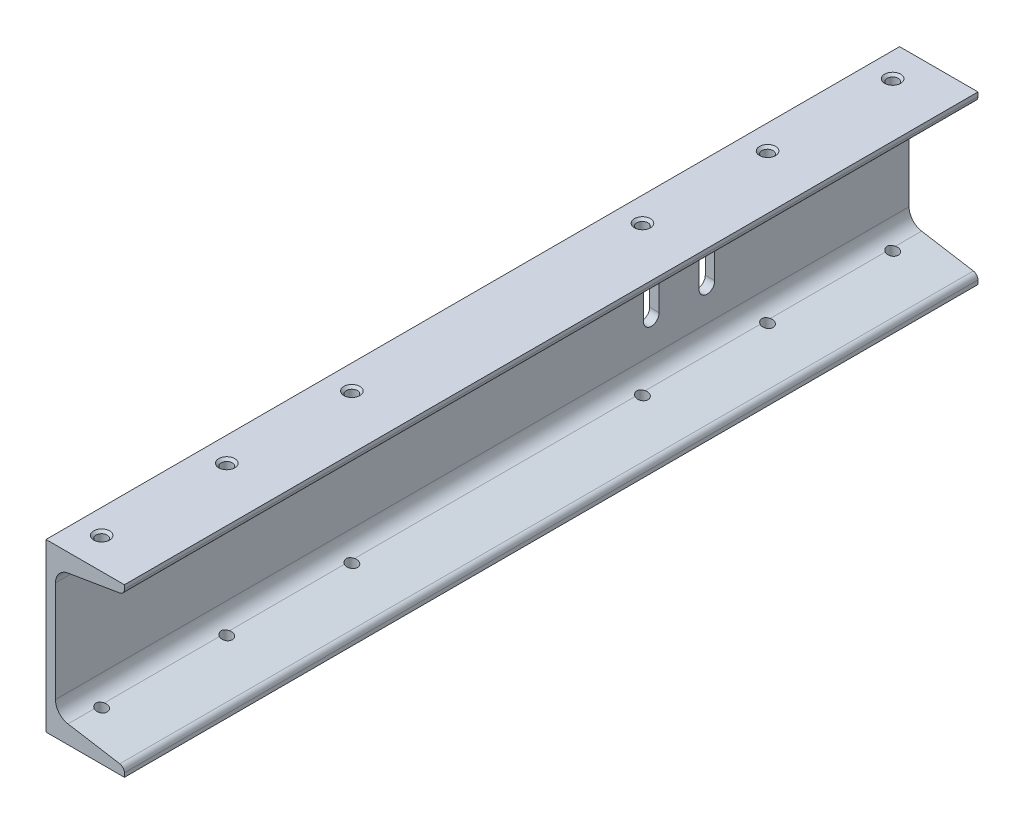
ISO-10303-21;
HEADER;
FILE_DESCRIPTION(('STEP AP214'),'2;1');
FILE_NAME('part.step','',(''),(''),'','','');
FILE_SCHEMA(('AUTOMOTIVE_DESIGN { 1 0 10303 214 1 1 1 1 }'));
ENDSEC;
DATA;
#1=APPLICATION_CONTEXT('core data for automotive mechanical design processes');
#2=APPLICATION_PROTOCOL_DEFINITION('international standard','automotive_design',2000,#1);
#3=PRODUCT_CONTEXT('',#1,'mechanical');
#4=PRODUCT('Part','Part','',(#3));
#5=PRODUCT_RELATED_PRODUCT_CATEGORY('part','',(#4));
#6=PRODUCT_DEFINITION_FORMATION('','',#4);
#7=PRODUCT_DEFINITION_CONTEXT('part definition',#1,'design');
#8=PRODUCT_DEFINITION('design','',#6,#7);
#9=PRODUCT_DEFINITION_SHAPE('','',#8);
#10=(LENGTH_UNIT() NAMED_UNIT(*) SI_UNIT(.MILLI.,.METRE.));
#11=(NAMED_UNIT(*) PLANE_ANGLE_UNIT() SI_UNIT($,.RADIAN.));
#12=(NAMED_UNIT(*) SI_UNIT($,.STERADIAN.) SOLID_ANGLE_UNIT());
#13=UNCERTAINTY_MEASURE_WITH_UNIT(LENGTH_MEASURE(1.E-05),#10,'distance_accuracy_value','');
#14=(GEOMETRIC_REPRESENTATION_CONTEXT(3) GLOBAL_UNCERTAINTY_ASSIGNED_CONTEXT((#13)) GLOBAL_UNIT_ASSIGNED_CONTEXT((#10,
#11,#12)) REPRESENTATION_CONTEXT('',''));
#15=CARTESIAN_POINT('',(0.,0.,0.));
#16=DIRECTION('',(0.,0.,1.));
#17=DIRECTION('',(1.,0.,0.));
#18=AXIS2_PLACEMENT_3D('',#15,#16,#17);
#19=CARTESIAN_POINT('',(0.,0.,389.899906));
#20=DIRECTION('',(0.,1.,0.));
#21=DIRECTION('',(-1.,0.,0.));
#22=AXIS2_PLACEMENT_3D('',#19,#20,#21);
#23=PLANE('',#22);
#24=CARTESIAN_POINT('',(11.1251999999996,0.,261.312406));
#25=DIRECTION('',(0.,-1.,0.));
#26=DIRECTION('',(0.,0.,-1.));
#27=AXIS2_PLACEMENT_3D('',#24,#25,#26);
#28=CIRCLE('',#27,3.6576);
#29=CARTESIAN_POINT('',(11.1251999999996,0.,257.654806));
#30=VERTEX_POINT('',#29);
#31=EDGE_CURVE('E524',#30,#30,#28,.T.);
#32=ORIENTED_EDGE('',*,*,#31,.F.);
#33=EDGE_LOOP('',(#32));
#34=FACE_BOUND('',#33,.T.);
#35=CARTESIAN_POINT('',(11.1251999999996,0.,375.612406));
#36=DIRECTION('',(0.,-1.,0.));
#37=DIRECTION('',(0.,0.,-1.));
#38=AXIS2_PLACEMENT_3D('',#35,#36,#37);
#39=CIRCLE('',#38,3.6576);
#40=CARTESIAN_POINT('',(11.1251999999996,0.,371.954806));
#41=VERTEX_POINT('',#40);
#42=EDGE_CURVE('E262',#41,#41,#39,.T.);
#43=ORIENTED_EDGE('',*,*,#42,.F.);
#44=EDGE_LOOP('',(#43));
#45=FACE_BOUND('',#44,.T.);
#46=CARTESIAN_POINT('',(11.1251999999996,0.,318.462406));
#47=DIRECTION('',(0.,-1.,0.));
#48=DIRECTION('',(0.,0.,-1.));
#49=AXIS2_PLACEMENT_3D('',#46,#47,#48);
#50=CIRCLE('',#49,3.6576);
#51=CARTESIAN_POINT('',(11.1251999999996,0.,314.804806));
#52=VERTEX_POINT('',#51);
#53=EDGE_CURVE('E513',#52,#52,#50,.T.);
#54=ORIENTED_EDGE('',*,*,#53,.F.);
#55=EDGE_LOOP('',(#54));
#56=FACE_BOUND('',#55,.T.);
#57=CARTESIAN_POINT('',(11.1251999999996,0.,14.2875));
#58=DIRECTION('',(0.,-1.,0.));
#59=DIRECTION('',(0.,0.,-1.));
#60=AXIS2_PLACEMENT_3D('',#57,#58,#59);
#61=CIRCLE('',#60,3.6576);
#62=CARTESIAN_POINT('',(11.1251999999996,0.,10.6299));
#63=VERTEX_POINT('',#62);
#64=EDGE_CURVE('E505',#63,#63,#61,.T.);
#65=ORIENTED_EDGE('',*,*,#64,.F.);
#66=EDGE_LOOP('',(#65));
#67=FACE_BOUND('',#66,.T.);
#68=CARTESIAN_POINT('',(11.1251999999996,0.,71.4375000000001));
#69=DIRECTION('',(0.,-1.,0.));
#70=DIRECTION('',(0.,0.,-1.));
#71=AXIS2_PLACEMENT_3D('',#68,#69,#70);
#72=CIRCLE('',#71,3.6576);
#73=CARTESIAN_POINT('',(11.1251999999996,0.,67.7799000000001));
#74=VERTEX_POINT('',#73);
#75=EDGE_CURVE('E496',#74,#74,#72,.T.);
#76=ORIENTED_EDGE('',*,*,#75,.F.);
#77=EDGE_LOOP('',(#76));
#78=FACE_BOUND('',#77,.T.);
#79=CARTESIAN_POINT('',(11.1251999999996,0.,128.5875));
#80=DIRECTION('',(0.,-1.,0.));
#81=DIRECTION('',(0.,0.,-1.));
#82=AXIS2_PLACEMENT_3D('',#79,#80,#81);
#83=CIRCLE('',#82,3.6576);
#84=CARTESIAN_POINT('',(11.1251999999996,0.,124.9299));
#85=VERTEX_POINT('',#84);
#86=EDGE_CURVE('E487',#85,#85,#83,.T.);
#87=ORIENTED_EDGE('',*,*,#86,.F.);
#88=EDGE_LOOP('',(#87));
#89=FACE_BOUND('',#88,.T.);
#90=DIRECTION('',(1.,0.,0.));
#91=VECTOR('',#90,1.);
#92=CARTESIAN_POINT('',(0.,0.,0.));
#93=LINE('',#92,#91);
#94=CARTESIAN_POINT('',(0.,0.,0.));
#95=VERTEX_POINT('',#94);
#96=CARTESIAN_POINT('',(35.814,0.,0.));
#97=VERTEX_POINT('',#96);
#98=EDGE_CURVE('E338',#95,#97,#93,.T.);
#99=ORIENTED_EDGE('',*,*,#98,.T.);
#100=DIRECTION('',(0.,0.,-1.));
#101=VECTOR('',#100,1.);
#102=CARTESIAN_POINT('',(35.814,0.,389.899906));
#103=LINE('',#102,#101);
#104=CARTESIAN_POINT('',(35.814,0.,389.899906));
#105=VERTEX_POINT('',#104);
#106=EDGE_CURVE('E547',#105,#97,#103,.T.);
#107=ORIENTED_EDGE('',*,*,#106,.F.);
#108=DIRECTION('',(1.,0.,0.));
#109=VECTOR('',#108,1.);
#110=CARTESIAN_POINT('',(0.,0.,389.899906));
#111=LINE('',#110,#109);
#112=CARTESIAN_POINT('',(0.,0.,389.899906));
#113=VERTEX_POINT('',#112);
#114=EDGE_CURVE('E316',#113,#105,#111,.T.);
#115=ORIENTED_EDGE('',*,*,#114,.F.);
#116=DIRECTION('',(0.,0.,-1.));
#117=VECTOR('',#116,1.);
#118=CARTESIAN_POINT('',(0.,0.,389.899906));
#119=LINE('',#118,#117);
#120=EDGE_CURVE('E310',#113,#95,#119,.T.);
#121=ORIENTED_EDGE('',*,*,#120,.T.);
#122=EDGE_LOOP('',(#99,#107,#115,#121));
#123=FACE_BOUND('',#122,.T.);
#124=ADVANCED_FACE('F41',(#34,#45,#56,#67,#78,#89,#123),#23,.F.);
#125=CARTESIAN_POINT('',(35.814,0.,389.899906));
#126=DIRECTION('',(-1.,0.,0.));
#127=DIRECTION('',(0.,-1.,0.));
#128=AXIS2_PLACEMENT_3D('',#125,#126,#127);
#129=PLANE('',#128);
#130=DIRECTION('',(0.,1.,0.));
#131=VECTOR('',#130,1.);
#132=CARTESIAN_POINT('',(35.814,0.,0.));
#133=LINE('',#132,#131);
#134=CARTESIAN_POINT('',(35.814,1.8125643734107,0.));
#135=VERTEX_POINT('',#134);
#136=EDGE_CURVE('E336',#97,#135,#133,.T.);
#137=ORIENTED_EDGE('',*,*,#136,.T.);
#138=DIRECTION('',(0.,0.,-1.));
#139=VECTOR('',#138,1.);
#140=CARTESIAN_POINT('',(35.814,1.8125643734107,389.899906));
#141=LINE('',#140,#139);
#142=CARTESIAN_POINT('',(35.814,1.8125643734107,389.899906));
#143=VERTEX_POINT('',#142);
#144=EDGE_CURVE('E559',#143,#135,#141,.T.);
#145=ORIENTED_EDGE('',*,*,#144,.F.);
#146=DIRECTION('',(0.,1.,0.));
#147=VECTOR('',#146,1.);
#148=CARTESIAN_POINT('',(35.814,0.,389.899906));
#149=LINE('',#148,#147);
#150=EDGE_CURVE('E361',#105,#143,#149,.T.);
#151=ORIENTED_EDGE('',*,*,#150,.F.);
#152=ORIENTED_EDGE('',*,*,#106,.T.);
#153=EDGE_LOOP('',(#137,#145,#151,#152));
#154=FACE_BOUND('',#153,.T.);
#155=ADVANCED_FACE('F532',(#154),#129,.F.);
#156=CARTESIAN_POINT('',(33.274,1.8125643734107,389.899906));
#157=DIRECTION('',(0.,0.,-1.));
#158=DIRECTION('',(-1.,0.,0.));
#159=AXIS2_PLACEMENT_3D('',#156,#157,#158);
#160=CYLINDRICAL_SURFACE('',#159,2.54);
#161=CARTESIAN_POINT('',(33.274,1.8125643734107,0.));
#162=DIRECTION('',(0.,0.,1.));
#163=DIRECTION('',(1.,0.,0.));
#164=AXIS2_PLACEMENT_3D('',#161,#162,#163);
#165=CIRCLE('',#164,2.54);
#166=CARTESIAN_POINT('',(33.6916030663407,4.31799999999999,0.));
#167=VERTEX_POINT('',#166);
#168=EDGE_CURVE('E334',#135,#167,#165,.T.);
#169=ORIENTED_EDGE('',*,*,#168,.T.);
#170=DIRECTION('',(0.,0.,-1.));
#171=VECTOR('',#170,1.);
#172=CARTESIAN_POINT('',(33.6916030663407,4.31799999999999,389.899906));
#173=LINE('',#172,#171);
#174=CARTESIAN_POINT('',(33.6916030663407,4.31799999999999,389.899906));
#175=VERTEX_POINT('',#174);
#176=EDGE_CURVE('E564',#175,#167,#173,.T.);
#177=ORIENTED_EDGE('',*,*,#176,.F.);
#178=CARTESIAN_POINT('',(33.274,1.8125643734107,389.899906));
#179=DIRECTION('',(0.,0.,1.));
#180=DIRECTION('',(1.,0.,0.));
#181=AXIS2_PLACEMENT_3D('',#178,#179,#180);
#182=CIRCLE('',#181,2.54);
#183=EDGE_CURVE('E359',#143,#175,#182,.T.);
#184=ORIENTED_EDGE('',*,*,#183,.F.);
#185=ORIENTED_EDGE('',*,*,#144,.T.);
#186=EDGE_LOOP('',(#169,#177,#184,#185));
#187=FACE_BOUND('',#186,.T.);
#188=ADVANCED_FACE('F1162',(#187),#160,.T.);
#189=CARTESIAN_POINT('',(10.0484717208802,8.25880935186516,389.899906));
#190=DIRECTION('',(-0.16441065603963,-0.986391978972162,0.));
#191=DIRECTION('',(0.986391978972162,-0.16441065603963,0.));
#192=AXIS2_PLACEMENT_3D('',#189,#190,#191);
#193=PLANE('',#192);
#194=DIRECTION('',(0.,0.,-1.));
#195=VECTOR('',#194,1.);
#196=CARTESIAN_POINT('',(10.0484717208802,8.25880935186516,389.899906));
#197=LINE('',#196,#195);
#198=CARTESIAN_POINT('',(10.0484717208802,8.25880935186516,258.997900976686));
#199=VERTEX_POINT('',#198);
#200=CARTESIAN_POINT('',(10.0484717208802,8.25880935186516,130.902005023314));
#201=VERTEX_POINT('',#200);
#202=EDGE_CURVE('E261',#199,#201,#197,.T.);
#203=ORIENTED_EDGE('',*,*,#202,.F.);
#204=CARTESIAN_POINT('',(11.1251999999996,8.07934154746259,261.312406));
#205=DIRECTION('',(-0.16441065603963,-0.986391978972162,0.));
#206=DIRECTION('',(0.986391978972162,-0.16441065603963,0.));
#207=AXIS2_PLACEMENT_3D('',#204,#205,#206);
#208=ELLIPSE('',#207,2.58791642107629,2.55269999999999);
#209=CARTESIAN_POINT('',(10.0484717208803,8.25880935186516,263.626911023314));
#210=VERTEX_POINT('',#209);
#211=EDGE_CURVE('E60',#199,#210,#208,.T.);
#212=ORIENTED_EDGE('',*,*,#211,.T.);
#213=CARTESIAN_POINT('',(10.0484717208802,8.25880935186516,316.147900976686));
#214=VERTEX_POINT('',#213);
#215=EDGE_CURVE('E259',#214,#210,#197,.T.);
#216=ORIENTED_EDGE('',*,*,#215,.F.);
#217=CARTESIAN_POINT('',(11.1251999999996,8.07934154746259,318.462406));
#218=DIRECTION('',(-0.16441065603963,-0.986391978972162,0.));
#219=DIRECTION('',(0.986391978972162,-0.16441065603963,0.));
#220=AXIS2_PLACEMENT_3D('',#217,#218,#219);
#221=ELLIPSE('',#220,2.58791642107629,2.55269999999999);
#222=CARTESIAN_POINT('',(10.0484717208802,8.25880935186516,320.776911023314));
#223=VERTEX_POINT('',#222);
#224=EDGE_CURVE('E508',#214,#223,#221,.T.);
#225=ORIENTED_EDGE('',*,*,#224,.T.);
#226=CARTESIAN_POINT('',(10.0484717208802,8.25880935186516,373.297900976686));
#227=VERTEX_POINT('',#226);
#228=EDGE_CURVE('E269',#227,#223,#197,.T.);
#229=ORIENTED_EDGE('',*,*,#228,.F.);
#230=CARTESIAN_POINT('',(11.1251999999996,8.07934154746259,375.612406));
#231=DIRECTION('',(-0.16441065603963,-0.986391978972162,0.));
#232=DIRECTION('',(0.986391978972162,-0.16441065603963,0.));
#233=AXIS2_PLACEMENT_3D('',#230,#231,#232);
#234=ELLIPSE('',#233,2.58791642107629,2.55269999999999);
#235=CARTESIAN_POINT('',(10.0484717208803,8.25880935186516,377.926911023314));
#236=VERTEX_POINT('',#235);
#237=EDGE_CURVE('E66',#227,#236,#234,.T.);
#238=ORIENTED_EDGE('',*,*,#237,.T.);
#239=CARTESIAN_POINT('',(10.0484717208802,8.25880935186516,389.899906));
#240=VERTEX_POINT('',#239);
#241=EDGE_CURVE('E272',#240,#236,#197,.T.);
#242=ORIENTED_EDGE('',*,*,#241,.F.);
#243=DIRECTION('',(-0.986391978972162,0.16441065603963,0.));
#244=VECTOR('',#243,1.);
#245=CARTESIAN_POINT('',(10.0484717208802,8.25880935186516,389.899906));
#246=LINE('',#245,#244);
#247=EDGE_CURVE('E357',#175,#240,#246,.T.);
#248=ORIENTED_EDGE('',*,*,#247,.F.);
#249=ORIENTED_EDGE('',*,*,#176,.T.);
#250=DIRECTION('',(-0.986391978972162,0.16441065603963,0.));
#251=VECTOR('',#250,1.);
#252=CARTESIAN_POINT('',(10.0484717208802,8.25880935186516,0.));
#253=LINE('',#252,#251);
#254=CARTESIAN_POINT('',(10.0484717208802,8.25880935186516,0.));
#255=VERTEX_POINT('',#254);
#256=EDGE_CURVE('E332',#167,#255,#253,.T.);
#257=ORIENTED_EDGE('',*,*,#256,.T.);
#258=CARTESIAN_POINT('',(10.0484717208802,8.25880935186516,11.9729949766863));
#259=VERTEX_POINT('',#258);
#260=EDGE_CURVE('E271',#259,#255,#197,.T.);
#261=ORIENTED_EDGE('',*,*,#260,.F.);
#262=CARTESIAN_POINT('',(11.1251999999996,8.07934154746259,14.2875));
#263=DIRECTION('',(-0.16441065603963,-0.986391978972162,0.));
#264=DIRECTION('',(0.986391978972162,-0.16441065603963,0.));
#265=AXIS2_PLACEMENT_3D('',#262,#263,#264);
#266=ELLIPSE('',#265,2.58791642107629,2.55269999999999);
#267=CARTESIAN_POINT('',(10.0484717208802,8.25880935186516,16.6020050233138));
#268=VERTEX_POINT('',#267);
#269=EDGE_CURVE('E499',#259,#268,#266,.T.);
#270=ORIENTED_EDGE('',*,*,#269,.T.);
#271=CARTESIAN_POINT('',(10.0484717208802,8.25880935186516,69.1229949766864));
#272=VERTEX_POINT('',#271);
#273=EDGE_CURVE('E276',#272,#268,#197,.T.);
#274=ORIENTED_EDGE('',*,*,#273,.F.);
#275=CARTESIAN_POINT('',(11.1251999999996,8.07934154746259,71.4375000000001));
#276=DIRECTION('',(-0.16441065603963,-0.986391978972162,0.));
#277=DIRECTION('',(0.986391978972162,-0.16441065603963,0.));
#278=AXIS2_PLACEMENT_3D('',#275,#276,#277);
#279=ELLIPSE('',#278,2.58791642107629,2.55269999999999);
#280=CARTESIAN_POINT('',(10.0484717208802,8.25880935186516,73.7520050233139));
#281=VERTEX_POINT('',#280);
#282=EDGE_CURVE('E490',#272,#281,#279,.T.);
#283=ORIENTED_EDGE('',*,*,#282,.T.);
#284=CARTESIAN_POINT('',(10.0484717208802,8.25880935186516,126.272994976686));
#285=VERTEX_POINT('',#284);
#286=EDGE_CURVE('E273',#285,#281,#197,.T.);
#287=ORIENTED_EDGE('',*,*,#286,.F.);
#288=CARTESIAN_POINT('',(11.1251999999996,8.07934154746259,128.5875));
#289=DIRECTION('',(-0.16441065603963,-0.986391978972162,0.));
#290=DIRECTION('',(0.986391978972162,-0.16441065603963,0.));
#291=AXIS2_PLACEMENT_3D('',#288,#289,#290);
#292=ELLIPSE('',#291,2.58791642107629,2.55269999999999);
#293=EDGE_CURVE('E464',#285,#201,#292,.T.);
#294=ORIENTED_EDGE('',*,*,#293,.T.);
#295=EDGE_LOOP('',(#203,#212,#216,#225,#229,#238,#242,#248,#249,#257,#261,#270,#274,#283,#287,#294));
#296=FACE_BOUND('',#295,.T.);
#297=ADVANCED_FACE('F257',(#296),#193,.F.);
#298=CARTESIAN_POINT('',(11.176,15.0234855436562,389.899906));
#299=DIRECTION('',(0.,0.,-1.));
#300=DIRECTION('',(-1.,0.,0.));
#301=AXIS2_PLACEMENT_3D('',#298,#299,#300);
#302=CYLINDRICAL_SURFACE('',#301,6.858);
#303=ORIENTED_EDGE('',*,*,#215,.T.);
#304=CARTESIAN_POINT('',(10.0484717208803,8.25880935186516,263.626911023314));
#305=CARTESIAN_POINT('',(9.98224837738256,8.26984365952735,263.596101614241));
#306=CARTESIAN_POINT('',(9.91749130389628,8.28164113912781,263.562518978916));
#307=CARTESIAN_POINT('',(9.79126879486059,8.30643181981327,263.490066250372));
#308=CARTESIAN_POINT('',(9.72980247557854,8.31942469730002,263.451197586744));
#309=CARTESIAN_POINT('',(9.55096570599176,8.35967887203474,263.327120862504));
#310=CARTESIAN_POINT('',(9.43900019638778,8.38824318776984,263.234368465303));
#311=CARTESIAN_POINT('',(9.23252075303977,8.44575208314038,263.03142333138));
#312=CARTESIAN_POINT('',(9.13799990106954,8.47469650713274,262.921237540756));
#313=CARTESIAN_POINT('',(8.96867738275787,8.52980966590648,262.685967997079));
#314=CARTESIAN_POINT('',(8.89387471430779,8.55597854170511,262.560885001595));
#315=CARTESIAN_POINT('',(8.76621053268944,8.60244755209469,262.298679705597));
#316=CARTESIAN_POINT('',(8.71338302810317,8.62273857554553,262.16153913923));
#317=CARTESIAN_POINT('',(8.63192143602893,8.65467277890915,261.879304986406));
#318=CARTESIAN_POINT('',(8.60327326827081,8.66632099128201,261.734216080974));
#319=CARTESIAN_POINT('',(8.57250087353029,8.67886503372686,261.450392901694));
#320=CARTESIAN_POINT('',(8.56877024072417,8.68041192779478,261.311860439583));
#321=CARTESIAN_POINT('',(8.58373429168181,8.67428186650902,261.03623697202));
#322=CARTESIAN_POINT('',(8.60242572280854,8.66660624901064,260.899145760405));
#323=CARTESIAN_POINT('',(8.66041214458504,8.64344653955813,260.635091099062));
#324=CARTESIAN_POINT('',(8.69898015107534,8.62823865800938,260.507941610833));
#325=CARTESIAN_POINT('',(8.79494521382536,8.59189467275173,260.261861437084));
#326=CARTESIAN_POINT('',(8.85234828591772,8.57075667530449,260.142933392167));
#327=CARTESIAN_POINT('',(8.98775868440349,8.52355103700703,259.910017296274));
#328=CARTESIAN_POINT('',(9.06667417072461,8.49728571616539,259.796598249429));
#329=CARTESIAN_POINT('',(9.24150887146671,8.44334337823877,259.584136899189));
#330=CARTESIAN_POINT('',(9.33742661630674,8.41566648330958,259.4850933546));
#331=CARTESIAN_POINT('',(9.5316751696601,8.36487126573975,259.314511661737));
#332=CARTESIAN_POINT('',(9.62832581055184,8.34160523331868,259.241097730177));
#333=CARTESIAN_POINT('',(9.83144470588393,8.29776858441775,259.108495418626));
#334=CARTESIAN_POINT('',(9.93791045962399,8.27719728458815,259.049303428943));
#335=CARTESIAN_POINT('',(10.0484717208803,8.25880935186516,258.997900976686));
#336=B_SPLINE_CURVE_WITH_KNOTS('',3,(#304,#305,#306,#307,#308,#309,#310,#311,#312,#313,#314,
#315,#316,#317,#318,#319,#320,#321,#322,#323,#324,#325,#326,#327,#328,#329,#330,#331,#332,#333,
#334,#335),.UNSPECIFIED.,.F.,.F.,(4,2,2,2,2,2,2,2,2,2,2,2,2,2,2,4),(0.,0.221452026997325,
0.442844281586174,0.88510828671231,1.32719651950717,1.7692622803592,2.21200965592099,
2.65449902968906,3.06816082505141,3.48176262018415,3.88121015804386,4.28078540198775,
4.70091941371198,5.12101712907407,5.49054832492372,5.85998563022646),.UNSPECIFIED.);
#337=EDGE_CURVE('E11',#210,#199,#336,.T.);
#338=ORIENTED_EDGE('',*,*,#337,.T.);
#339=ORIENTED_EDGE('',*,*,#202,.T.);
#340=CARTESIAN_POINT('',(10.0484717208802,8.25880935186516,130.902005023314));
#341=CARTESIAN_POINT('',(9.98224837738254,8.26984365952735,130.871195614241));
#342=CARTESIAN_POINT('',(9.91749130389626,8.28164113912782,130.837612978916));
#343=CARTESIAN_POINT('',(9.79126879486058,8.30643181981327,130.765160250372));
#344=CARTESIAN_POINT('',(9.72980247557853,8.31942469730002,130.726291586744));
#345=CARTESIAN_POINT('',(9.55096570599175,8.35967887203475,130.602214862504));
#346=CARTESIAN_POINT('',(9.43900019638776,8.38824318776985,130.509462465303));
#347=CARTESIAN_POINT('',(9.23252075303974,8.44575208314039,130.30651733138));
#348=CARTESIAN_POINT('',(9.1379999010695,8.47469650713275,130.196331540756));
#349=CARTESIAN_POINT('',(8.96867738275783,8.52980966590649,129.961061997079));
#350=CARTESIAN_POINT('',(8.89387471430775,8.55597854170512,129.835979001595));
#351=CARTESIAN_POINT('',(8.7662105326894,8.6024475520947,129.573773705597));
#352=CARTESIAN_POINT('',(8.71338302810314,8.62273857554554,129.43663313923));
#353=CARTESIAN_POINT('',(8.6319214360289,8.65467277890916,129.154398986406));
#354=CARTESIAN_POINT('',(8.6032732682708,8.66632099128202,129.009310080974));
#355=CARTESIAN_POINT('',(8.57250087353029,8.67886503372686,128.725486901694));
#356=CARTESIAN_POINT('',(8.56877024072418,8.68041192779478,128.586954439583));
#357=CARTESIAN_POINT('',(8.58373429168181,8.67428186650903,128.31133097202));
#358=CARTESIAN_POINT('',(8.60242572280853,8.66660624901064,128.174239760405));
#359=CARTESIAN_POINT('',(8.66041214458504,8.64344653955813,127.910185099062));
#360=CARTESIAN_POINT('',(8.69898015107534,8.62823865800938,127.783035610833));
#361=CARTESIAN_POINT('',(8.79494521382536,8.59189467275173,127.536955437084));
#362=CARTESIAN_POINT('',(8.85234828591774,8.57075667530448,127.418027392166));
#363=CARTESIAN_POINT('',(8.9877586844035,8.52355103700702,127.185111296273));
#364=CARTESIAN_POINT('',(9.06667417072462,8.49728571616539,127.071692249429));
#365=CARTESIAN_POINT('',(9.2415088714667,8.44334337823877,126.859230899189));
#366=CARTESIAN_POINT('',(9.33742661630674,8.41566648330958,126.7601873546));
#367=CARTESIAN_POINT('',(9.53167516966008,8.36487126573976,126.589605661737));
#368=CARTESIAN_POINT('',(9.62832581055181,8.34160523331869,126.516191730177));
#369=CARTESIAN_POINT('',(9.8314447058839,8.29776858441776,126.383589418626));
#370=CARTESIAN_POINT('',(9.93791045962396,8.27719728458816,126.324397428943));
#371=CARTESIAN_POINT('',(10.0484717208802,8.25880935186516,126.272994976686));
#372=B_SPLINE_CURVE_WITH_KNOTS('',3,(#340,#341,#342,#343,#344,#345,#346,#347,#348,#349,#350,
#351,#352,#353,#354,#355,#356,#357,#358,#359,#360,#361,#362,#363,#364,#365,#366,#367,#368,#369,
#370,#371),.UNSPECIFIED.,.F.,.F.,(4,2,2,2,2,2,2,2,2,2,2,2,2,2,2,4),(0.,0.22145202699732,
0.44284428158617,0.885108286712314,1.32719651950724,1.76926228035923,2.21200965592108,
2.65449902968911,3.06816082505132,3.48176262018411,3.88121015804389,4.28078540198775,
4.70091941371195,5.121017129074,5.49054832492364,5.85998563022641),.UNSPECIFIED.);
#373=EDGE_CURVE('E697',#201,#285,#372,.T.);
#374=ORIENTED_EDGE('',*,*,#373,.T.);
#375=ORIENTED_EDGE('',*,*,#286,.T.);
#376=CARTESIAN_POINT('',(10.0484717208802,8.25880935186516,73.7520050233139));
#377=CARTESIAN_POINT('',(9.98224837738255,8.26984365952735,73.721195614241));
#378=CARTESIAN_POINT('',(9.91749130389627,8.28164113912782,73.6876129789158));
#379=CARTESIAN_POINT('',(9.79126879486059,8.30643181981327,73.6151602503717));
#380=CARTESIAN_POINT('',(9.72980247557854,8.31942469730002,73.5762915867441));
#381=CARTESIAN_POINT('',(9.55096570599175,8.35967887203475,73.4522148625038));
#382=CARTESIAN_POINT('',(9.43900019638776,8.38824318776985,73.3594624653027));
#383=CARTESIAN_POINT('',(9.23252075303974,8.44575208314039,73.1565173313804));
#384=CARTESIAN_POINT('',(9.1379999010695,8.47469650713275,73.0463315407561));
#385=CARTESIAN_POINT('',(8.96867738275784,8.52980966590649,72.8110619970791));
#386=CARTESIAN_POINT('',(8.89387471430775,8.55597854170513,72.6859790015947));
#387=CARTESIAN_POINT('',(8.7662105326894,8.6024475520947,72.4237737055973));
#388=CARTESIAN_POINT('',(8.71338302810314,8.62273857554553,72.2866331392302));
#389=CARTESIAN_POINT('',(8.63192143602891,8.65467277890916,72.0043989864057));
#390=CARTESIAN_POINT('',(8.6032732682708,8.66632099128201,71.859310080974));
#391=CARTESIAN_POINT('',(8.57250087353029,8.67886503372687,71.5754869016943));
#392=CARTESIAN_POINT('',(8.56877024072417,8.68041192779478,71.4369544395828));
#393=CARTESIAN_POINT('',(8.58373429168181,8.67428186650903,71.1613309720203));
#394=CARTESIAN_POINT('',(8.60242572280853,8.66660624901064,71.0242397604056));
#395=CARTESIAN_POINT('',(8.66041214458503,8.64344653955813,70.7601850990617));
#396=CARTESIAN_POINT('',(8.69898015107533,8.62823865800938,70.6330356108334));
#397=CARTESIAN_POINT('',(8.79494521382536,8.59189467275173,70.3869554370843));
#398=CARTESIAN_POINT('',(8.85234828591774,8.57075667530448,70.2680273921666));
#399=CARTESIAN_POINT('',(8.98775868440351,8.52355103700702,70.0351112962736));
#400=CARTESIAN_POINT('',(9.06667417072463,8.49728571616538,69.9216922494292));
#401=CARTESIAN_POINT('',(9.24150887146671,8.44334337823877,69.7092308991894));
#402=CARTESIAN_POINT('',(9.33742661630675,8.41566648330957,69.6101873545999));
#403=CARTESIAN_POINT('',(9.53167516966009,8.36487126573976,69.4396056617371));
#404=CARTESIAN_POINT('',(9.62832581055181,8.34160523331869,69.3661917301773));
#405=CARTESIAN_POINT('',(9.83144470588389,8.29776858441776,69.233589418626));
#406=CARTESIAN_POINT('',(9.93791045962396,8.27719728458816,69.1743974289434));
#407=CARTESIAN_POINT('',(10.0484717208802,8.25880935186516,69.1229949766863));
#408=B_SPLINE_CURVE_WITH_KNOTS('',3,(#376,#377,#378,#379,#380,#381,#382,#383,#384,#385,#386,
#387,#388,#389,#390,#391,#392,#393,#394,#395,#396,#397,#398,#399,#400,#401,#402,#403,#404,#405,
#406,#407),.UNSPECIFIED.,.F.,.F.,(4,2,2,2,2,2,2,2,2,2,2,2,2,2,2,4),(0.,0.221452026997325,
0.442844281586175,0.885108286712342,1.32719651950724,1.76926228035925,2.21200965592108,
2.6544990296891,3.06816082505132,3.48176262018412,3.88121015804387,4.28078540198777,
4.70091941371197,5.12101712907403,5.49054832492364,5.85998563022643),.UNSPECIFIED.);
#409=EDGE_CURVE('E760',#281,#272,#408,.T.);
#410=ORIENTED_EDGE('',*,*,#409,.T.);
#411=ORIENTED_EDGE('',*,*,#273,.T.);
#412=CARTESIAN_POINT('',(10.0484717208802,8.25880935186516,16.6020050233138));
#413=CARTESIAN_POINT('',(9.98224837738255,8.26984365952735,16.5711956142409));
#414=CARTESIAN_POINT('',(9.91749130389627,8.28164113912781,16.5376129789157));
#415=CARTESIAN_POINT('',(9.79126879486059,8.30643181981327,16.4651602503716));
#416=CARTESIAN_POINT('',(9.72980247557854,8.31942469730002,16.4262915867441));
#417=CARTESIAN_POINT('',(9.55096570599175,8.35967887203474,16.3022148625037));
#418=CARTESIAN_POINT('',(9.43900019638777,8.38824318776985,16.2094624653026));
#419=CARTESIAN_POINT('',(9.23252075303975,8.44575208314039,16.0065173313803));
#420=CARTESIAN_POINT('',(9.13799990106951,8.47469650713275,15.896331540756));
#421=CARTESIAN_POINT('',(8.96867738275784,8.52980966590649,15.661061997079));
#422=CARTESIAN_POINT('',(8.89387471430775,8.55597854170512,15.5359790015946));
#423=CARTESIAN_POINT('',(8.7662105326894,8.6024475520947,15.2737737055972));
#424=CARTESIAN_POINT('',(8.71338302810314,8.62273857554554,15.1366331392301));
#425=CARTESIAN_POINT('',(8.63192143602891,8.65467277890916,14.8543989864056));
#426=CARTESIAN_POINT('',(8.6032732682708,8.66632099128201,14.7093100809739));
#427=CARTESIAN_POINT('',(8.57250087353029,8.67886503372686,14.4254869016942));
#428=CARTESIAN_POINT('',(8.56877024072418,8.68041192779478,14.2869544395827));
#429=CARTESIAN_POINT('',(8.58373429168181,8.67428186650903,14.0113309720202));
#430=CARTESIAN_POINT('',(8.60242572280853,8.66660624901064,13.8742397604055));
#431=CARTESIAN_POINT('',(8.66041214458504,8.64344653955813,13.6101850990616));
#432=CARTESIAN_POINT('',(8.69898015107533,8.62823865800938,13.4830356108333));
#433=CARTESIAN_POINT('',(8.79494521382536,8.59189467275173,13.2369554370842));
#434=CARTESIAN_POINT('',(8.85234828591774,8.57075667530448,13.1180273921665));
#435=CARTESIAN_POINT('',(8.98775868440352,8.52355103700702,12.8851112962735));
#436=CARTESIAN_POINT('',(9.06667417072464,8.49728571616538,12.7716922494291));
#437=CARTESIAN_POINT('',(9.24150887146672,8.44334337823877,12.5592308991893));
#438=CARTESIAN_POINT('',(9.33742661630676,8.41566648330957,12.4601873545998));
#439=CARTESIAN_POINT('',(9.5316751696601,8.36487126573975,12.289605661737));
#440=CARTESIAN_POINT('',(9.62832581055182,8.34160523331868,12.2161917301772));
#441=CARTESIAN_POINT('',(9.83144470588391,8.29776858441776,12.0835894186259));
#442=CARTESIAN_POINT('',(9.93791045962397,8.27719728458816,12.0243974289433));
#443=CARTESIAN_POINT('',(10.0484717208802,8.25880935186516,11.9729949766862));
#444=B_SPLINE_CURVE_WITH_KNOTS('',3,(#412,#413,#414,#415,#416,#417,#418,#419,#420,#421,#422,
#423,#424,#425,#426,#427,#428,#429,#430,#431,#432,#433,#434,#435,#436,#437,#438,#439,#440,#441,
#442,#443),.UNSPECIFIED.,.F.,.F.,(4,2,2,2,2,2,2,2,2,2,2,2,2,2,2,4),(0.,0.221452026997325,
0.442844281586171,0.885108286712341,1.32719651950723,1.76926228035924,2.21200965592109,
2.65449902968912,3.06816082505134,3.48176262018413,3.88121015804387,4.28078540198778,
4.70091941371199,5.12101712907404,5.49054832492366,5.85998563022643),.UNSPECIFIED.);
#445=EDGE_CURVE('E768',#268,#259,#444,.T.);
#446=ORIENTED_EDGE('',*,*,#445,.T.);
#447=ORIENTED_EDGE('',*,*,#260,.T.);
#448=CARTESIAN_POINT('',(11.176,15.0234855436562,0.));
#449=DIRECTION('',(0.,0.,-1.));
#450=DIRECTION('',(1.,0.,0.));
#451=AXIS2_PLACEMENT_3D('',#448,#449,#450);
#452=CIRCLE('',#451,6.858);
#453=CARTESIAN_POINT('',(4.31800000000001,15.0234855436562,0.));
#454=VERTEX_POINT('',#453);
#455=EDGE_CURVE('E330',#255,#454,#452,.T.);
#456=ORIENTED_EDGE('',*,*,#455,.T.);
#457=DIRECTION('',(0.,0.,-1.));
#458=VECTOR('',#457,1.);
#459=CARTESIAN_POINT('',(4.31800000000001,15.0234855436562,389.899906));
#460=LINE('',#459,#458);
#461=CARTESIAN_POINT('',(4.31800000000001,15.0234855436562,389.899906));
#462=VERTEX_POINT('',#461);
#463=EDGE_CURVE('E277',#462,#454,#460,.T.);
#464=ORIENTED_EDGE('',*,*,#463,.F.);
#465=CARTESIAN_POINT('',(11.176,15.0234855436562,389.899906));
#466=DIRECTION('',(0.,0.,-1.));
#467=DIRECTION('',(1.,0.,0.));
#468=AXIS2_PLACEMENT_3D('',#465,#466,#467);
#469=CIRCLE('',#468,6.858);
#470=EDGE_CURVE('E355',#240,#462,#469,.T.);
#471=ORIENTED_EDGE('',*,*,#470,.F.);
#472=ORIENTED_EDGE('',*,*,#241,.T.);
#473=CARTESIAN_POINT('',(10.0484717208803,8.25880935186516,377.926911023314));
#474=CARTESIAN_POINT('',(9.98224837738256,8.26984365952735,377.896101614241));
#475=CARTESIAN_POINT('',(9.91749130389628,8.28164113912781,377.862518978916));
#476=CARTESIAN_POINT('',(9.79126879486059,8.30643181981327,377.790066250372));
#477=CARTESIAN_POINT('',(9.72980247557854,8.31942469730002,377.751197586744));
#478=CARTESIAN_POINT('',(9.55096570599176,8.35967887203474,377.627120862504));
#479=CARTESIAN_POINT('',(9.43900019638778,8.38824318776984,377.534368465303));
#480=CARTESIAN_POINT('',(9.23252075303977,8.44575208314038,377.33142333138));
#481=CARTESIAN_POINT('',(9.13799990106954,8.47469650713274,377.221237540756));
#482=CARTESIAN_POINT('',(8.96867738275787,8.52980966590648,376.985967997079));
#483=CARTESIAN_POINT('',(8.89387471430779,8.55597854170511,376.860885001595));
#484=CARTESIAN_POINT('',(8.76621053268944,8.60244755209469,376.598679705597));
#485=CARTESIAN_POINT('',(8.71338302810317,8.62273857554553,376.46153913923));
#486=CARTESIAN_POINT('',(8.63192143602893,8.65467277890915,376.179304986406));
#487=CARTESIAN_POINT('',(8.60327326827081,8.66632099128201,376.034216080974));
#488=CARTESIAN_POINT('',(8.57250087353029,8.67886503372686,375.750392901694));
#489=CARTESIAN_POINT('',(8.56877024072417,8.68041192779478,375.611860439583));
#490=CARTESIAN_POINT('',(8.58373429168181,8.67428186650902,375.33623697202));
#491=CARTESIAN_POINT('',(8.60242572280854,8.66660624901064,375.199145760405));
#492=CARTESIAN_POINT('',(8.66041214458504,8.64344653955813,374.935091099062));
#493=CARTESIAN_POINT('',(8.69898015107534,8.62823865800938,374.807941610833));
#494=CARTESIAN_POINT('',(8.79494521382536,8.59189467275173,374.561861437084));
#495=CARTESIAN_POINT('',(8.85234828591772,8.57075667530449,374.442933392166));
#496=CARTESIAN_POINT('',(8.98775868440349,8.52355103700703,374.210017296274));
#497=CARTESIAN_POINT('',(9.06667417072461,8.49728571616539,374.096598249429));
#498=CARTESIAN_POINT('',(9.2415088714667,8.44334337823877,373.884136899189));
#499=CARTESIAN_POINT('',(9.33742661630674,8.41566648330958,373.7850933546));
#500=CARTESIAN_POINT('',(9.53167516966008,8.36487126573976,373.614511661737));
#501=CARTESIAN_POINT('',(9.62832581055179,8.34160523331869,373.541097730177));
#502=CARTESIAN_POINT('',(9.83144470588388,8.29776858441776,373.408495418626));
#503=CARTESIAN_POINT('',(9.93791045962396,8.27719728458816,373.349303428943));
#504=CARTESIAN_POINT('',(10.0484717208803,8.25880935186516,373.297900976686));
#505=B_SPLINE_CURVE_WITH_KNOTS('',3,(#473,#474,#475,#476,#477,#478,#479,#480,#481,#482,#483,
#484,#485,#486,#487,#488,#489,#490,#491,#492,#493,#494,#495,#496,#497,#498,#499,#500,#501,#502,
#503,#504),.UNSPECIFIED.,.F.,.F.,(4,2,2,2,2,2,2,2,2,2,2,2,2,2,2,4),(0.,0.221452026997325,
0.442844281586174,0.88510828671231,1.32719651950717,1.7692622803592,2.21200965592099,
2.65449902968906,3.06816082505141,3.48176262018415,3.88121015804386,4.28078540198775,
4.70091941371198,5.12101712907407,5.49054832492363,5.85998563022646),.UNSPECIFIED.);
#506=EDGE_CURVE('E54',#236,#227,#505,.T.);
#507=ORIENTED_EDGE('',*,*,#506,.T.);
#508=ORIENTED_EDGE('',*,*,#228,.T.);
#509=CARTESIAN_POINT('',(10.0484717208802,8.25880935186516,320.776911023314));
#510=CARTESIAN_POINT('',(9.98224837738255,8.26984365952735,320.746101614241));
#511=CARTESIAN_POINT('',(9.91749130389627,8.28164113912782,320.712518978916));
#512=CARTESIAN_POINT('',(9.79126879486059,8.30643181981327,320.640066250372));
#513=CARTESIAN_POINT('',(9.72980247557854,8.31942469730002,320.601197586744));
#514=CARTESIAN_POINT('',(9.55096570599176,8.35967887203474,320.477120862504));
#515=CARTESIAN_POINT('',(9.43900019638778,8.38824318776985,320.384368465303));
#516=CARTESIAN_POINT('',(9.23252075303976,8.44575208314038,320.18142333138));
#517=CARTESIAN_POINT('',(9.13799990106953,8.47469650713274,320.071237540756));
#518=CARTESIAN_POINT('',(8.96867738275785,8.52980966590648,319.835967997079));
#519=CARTESIAN_POINT('',(8.89387471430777,8.55597854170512,319.710885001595));
#520=CARTESIAN_POINT('',(8.76621053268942,8.6024475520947,319.448679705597));
#521=CARTESIAN_POINT('',(8.71338302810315,8.62273857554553,319.31153913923));
#522=CARTESIAN_POINT('',(8.63192143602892,8.65467277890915,319.029304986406));
#523=CARTESIAN_POINT('',(8.60327326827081,8.66632099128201,318.884216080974));
#524=CARTESIAN_POINT('',(8.57250087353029,8.67886503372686,318.600392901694));
#525=CARTESIAN_POINT('',(8.56877024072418,8.68041192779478,318.461860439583));
#526=CARTESIAN_POINT('',(8.58373429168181,8.67428186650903,318.18623697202));
#527=CARTESIAN_POINT('',(8.60242572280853,8.66660624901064,318.049145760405));
#528=CARTESIAN_POINT('',(8.66041214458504,8.64344653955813,317.785091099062));
#529=CARTESIAN_POINT('',(8.69898015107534,8.62823865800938,317.657941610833));
#530=CARTESIAN_POINT('',(8.79494521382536,8.59189467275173,317.411861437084));
#531=CARTESIAN_POINT('',(8.85234828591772,8.57075667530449,317.292933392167));
#532=CARTESIAN_POINT('',(8.98775868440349,8.52355103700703,317.060017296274));
#533=CARTESIAN_POINT('',(9.06667417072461,8.49728571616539,316.946598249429));
#534=CARTESIAN_POINT('',(9.2415088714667,8.44334337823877,316.734136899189));
#535=CARTESIAN_POINT('',(9.33742661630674,8.41566648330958,316.6350933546));
#536=CARTESIAN_POINT('',(9.53167516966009,8.36487126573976,316.464511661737));
#537=CARTESIAN_POINT('',(9.62832581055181,8.34160523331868,316.391097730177));
#538=CARTESIAN_POINT('',(9.83144470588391,8.29776858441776,316.258495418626));
#539=CARTESIAN_POINT('',(9.93791045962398,8.27719728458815,316.199303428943));
#540=CARTESIAN_POINT('',(10.0484717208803,8.25880935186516,316.147900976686));
#541=B_SPLINE_CURVE_WITH_KNOTS('',3,(#509,#510,#511,#512,#513,#514,#515,#516,#517,#518,#519,
#520,#521,#522,#523,#524,#525,#526,#527,#528,#529,#530,#531,#532,#533,#534,#535,#536,#537,#538,
#539,#540),.UNSPECIFIED.,.F.,.F.,(4,2,2,2,2,2,2,2,2,2,2,2,2,2,2,4),(0.,0.221452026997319,
0.442844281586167,0.885108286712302,1.32719651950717,1.76926228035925,2.21200965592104,
2.65449902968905,3.06816082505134,3.48176262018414,3.88121015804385,4.28078540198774,
4.70091941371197,5.12101712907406,5.49054832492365,5.85998563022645),.UNSPECIFIED.);
#542=EDGE_CURVE('E268',#223,#214,#541,.T.);
#543=ORIENTED_EDGE('',*,*,#542,.T.);
#544=EDGE_LOOP('',(#303,#338,#339,#374,#375,#410,#411,#446,#447,#456,#464,#471,#472,#507,#508,#543));
#545=FACE_BOUND('',#544,.T.);
#546=ADVANCED_FACE('F266',(#545),#302,.F.);
#547=CARTESIAN_POINT('',(4.318,61.1765144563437,389.899906));
#548=DIRECTION('',(-1.,0.,0.));
#549=DIRECTION('',(0.,-1.,0.));
#550=AXIS2_PLACEMENT_3D('',#547,#548,#549);
#551=PLANE('',#550);
#552=DIRECTION('',(0.,-1.,0.));
#553=VECTOR('',#552,1.);
#554=CARTESIAN_POINT('',(4.318,61.1765144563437,88.7603000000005));
#555=LINE('',#554,#553);
#556=CARTESIAN_POINT('',(4.318,46.0375,88.7603000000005));
#557=VERTEX_POINT('',#556);
#558=CARTESIAN_POINT('',(4.318,30.1625,88.7603000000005));
#559=VERTEX_POINT('',#558);
#560=EDGE_CURVE('E421',#557,#559,#555,.T.);
#561=ORIENTED_EDGE('',*,*,#560,.T.);
#562=CARTESIAN_POINT('',(4.31800000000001,30.1625,92.3290000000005));
#563=DIRECTION('',(-1.,0.,0.));
#564=DIRECTION('',(0.,-1.,0.));
#565=AXIS2_PLACEMENT_3D('',#562,#563,#564);
#566=CIRCLE('',#565,3.5687);
#567=CARTESIAN_POINT('',(4.318,30.1625,95.8977000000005));
#568=VERTEX_POINT('',#567);
#569=EDGE_CURVE('E418',#559,#568,#566,.T.);
#570=ORIENTED_EDGE('',*,*,#569,.T.);
#571=DIRECTION('',(0.,1.,0.));
#572=VECTOR('',#571,1.);
#573=CARTESIAN_POINT('',(4.318,61.1765144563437,95.8977000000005));
#574=LINE('',#573,#572);
#575=CARTESIAN_POINT('',(4.318,46.0375,95.8977000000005));
#576=VERTEX_POINT('',#575);
#577=EDGE_CURVE('E427',#568,#576,#574,.T.);
#578=ORIENTED_EDGE('',*,*,#577,.T.);
#579=CARTESIAN_POINT('',(4.318,46.0375,92.3290000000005));
#580=DIRECTION('',(-1.,0.,0.));
#581=DIRECTION('',(0.,-1.,0.));
#582=AXIS2_PLACEMENT_3D('',#579,#580,#581);
#583=CIRCLE('',#582,3.5687);
#584=EDGE_CURVE('E424',#576,#557,#583,.T.);
#585=ORIENTED_EDGE('',*,*,#584,.T.);
#586=EDGE_LOOP('',(#561,#570,#578,#585));
#587=FACE_BOUND('',#586,.T.);
#588=DIRECTION('',(0.,-1.,0.));
#589=VECTOR('',#588,1.);
#590=CARTESIAN_POINT('',(4.318,61.1765144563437,114.1603));
#591=LINE('',#590,#589);
#592=CARTESIAN_POINT('',(4.318,46.0375,114.1603));
#593=VERTEX_POINT('',#592);
#594=CARTESIAN_POINT('',(4.318,30.1625,114.1603));
#595=VERTEX_POINT('',#594);
#596=EDGE_CURVE('E433',#593,#595,#591,.T.);
#597=ORIENTED_EDGE('',*,*,#596,.T.);
#598=CARTESIAN_POINT('',(4.31800000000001,30.1625,117.729));
#599=DIRECTION('',(-1.,0.,0.));
#600=DIRECTION('',(0.,-1.,0.));
#601=AXIS2_PLACEMENT_3D('',#598,#599,#600);
#602=CIRCLE('',#601,3.5687);
#603=CARTESIAN_POINT('',(4.318,30.1625,121.2977));
#604=VERTEX_POINT('',#603);
#605=EDGE_CURVE('E430',#595,#604,#602,.T.);
#606=ORIENTED_EDGE('',*,*,#605,.T.);
#607=DIRECTION('',(0.,1.,0.));
#608=VECTOR('',#607,1.);
#609=CARTESIAN_POINT('',(4.318,61.1765144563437,121.2977));
#610=LINE('',#609,#608);
#611=CARTESIAN_POINT('',(4.318,46.0375,121.2977));
#612=VERTEX_POINT('',#611);
#613=EDGE_CURVE('E439',#604,#612,#610,.T.);
#614=ORIENTED_EDGE('',*,*,#613,.T.);
#615=CARTESIAN_POINT('',(4.318,46.0375,117.729));
#616=DIRECTION('',(-1.,0.,0.));
#617=DIRECTION('',(0.,-1.,0.));
#618=AXIS2_PLACEMENT_3D('',#615,#616,#617);
#619=CIRCLE('',#618,3.5687);
#620=EDGE_CURVE('E436',#612,#593,#619,.T.);
#621=ORIENTED_EDGE('',*,*,#620,.T.);
#622=EDGE_LOOP('',(#597,#606,#614,#621));
#623=FACE_BOUND('',#622,.T.);
#624=DIRECTION('',(0.,1.,0.));
#625=VECTOR('',#624,1.);
#626=CARTESIAN_POINT('',(4.318,61.1765144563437,0.));
#627=LINE('',#626,#625);
#628=CARTESIAN_POINT('',(4.31799999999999,61.1765144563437,0.));
#629=VERTEX_POINT('',#628);
#630=EDGE_CURVE('E328',#454,#629,#627,.T.);
#631=ORIENTED_EDGE('',*,*,#630,.T.);
#632=DIRECTION('',(0.,0.,-1.));
#633=VECTOR('',#632,1.);
#634=CARTESIAN_POINT('',(4.31799999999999,61.1765144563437,389.899906));
#635=LINE('',#634,#633);
#636=CARTESIAN_POINT('',(4.31799999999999,61.1765144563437,389.899906));
#637=VERTEX_POINT('',#636);
#638=EDGE_CURVE('E283',#637,#629,#635,.T.);
#639=ORIENTED_EDGE('',*,*,#638,.F.);
#640=DIRECTION('',(0.,1.,0.));
#641=VECTOR('',#640,1.);
#642=CARTESIAN_POINT('',(4.318,61.1765144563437,389.899906));
#643=LINE('',#642,#641);
#644=EDGE_CURVE('E353',#462,#637,#643,.T.);
#645=ORIENTED_EDGE('',*,*,#644,.F.);
#646=ORIENTED_EDGE('',*,*,#463,.T.);
#647=EDGE_LOOP('',(#631,#639,#645,#646));
#648=FACE_BOUND('',#647,.T.);
#649=ADVANCED_FACE('F617',(#587,#623,#648),#551,.F.);
#650=CARTESIAN_POINT('',(11.176,61.1765144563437,389.899906));
#651=DIRECTION('',(0.,0.,-1.));
#652=DIRECTION('',(-1.,0.,0.));
#653=AXIS2_PLACEMENT_3D('',#650,#651,#652);
#654=CYLINDRICAL_SURFACE('',#653,6.85800000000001);
#655=DIRECTION('',(0.,0.,-1.));
#656=VECTOR('',#655,1.);
#657=CARTESIAN_POINT('',(10.0484717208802,67.9411906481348,389.899906));
#658=LINE('',#657,#656);
#659=CARTESIAN_POINT('',(10.0484717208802,67.9411906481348,258.997900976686));
#660=VERTEX_POINT('',#659);
#661=CARTESIAN_POINT('',(10.0484717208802,67.9411906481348,130.902005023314));
#662=VERTEX_POINT('',#661);
#663=EDGE_CURVE('E295',#660,#662,#658,.T.);
#664=ORIENTED_EDGE('',*,*,#663,.F.);
#665=CARTESIAN_POINT('',(10.0484717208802,67.9411906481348,258.997900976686));
#666=CARTESIAN_POINT('',(9.98224837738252,67.9301563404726,259.028710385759));
#667=CARTESIAN_POINT('',(9.91749130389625,67.9183588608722,259.062293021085));
#668=CARTESIAN_POINT('',(9.7912687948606,67.8935681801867,259.134745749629));
#669=CARTESIAN_POINT('',(9.72980247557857,67.8805753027,259.173614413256));
#670=CARTESIAN_POINT('',(9.55096570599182,67.8403211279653,259.297691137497));
#671=CARTESIAN_POINT('',(9.43900019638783,67.8117568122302,259.390443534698));
#672=CARTESIAN_POINT('',(9.23252075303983,67.7542479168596,259.59338866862));
#673=CARTESIAN_POINT('',(9.13799990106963,67.7253034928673,259.703574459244));
#674=CARTESIAN_POINT('',(8.96867738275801,67.6701903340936,259.938844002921));
#675=CARTESIAN_POINT('',(8.89387471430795,67.6440214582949,260.063926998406));
#676=CARTESIAN_POINT('',(8.76621053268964,67.5975524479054,260.326132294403));
#677=CARTESIAN_POINT('',(8.7133830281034,67.5772614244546,260.46327286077));
#678=CARTESIAN_POINT('',(8.63192143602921,67.545327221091,260.745507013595));
#679=CARTESIAN_POINT('',(8.60327326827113,67.5336790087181,260.890595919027));
#680=CARTESIAN_POINT('',(8.57250087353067,67.5211349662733,261.174419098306));
#681=CARTESIAN_POINT('',(8.56877024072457,67.5195880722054,261.312951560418));
#682=CARTESIAN_POINT('',(8.58373429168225,67.5257181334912,261.58857502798));
#683=CARTESIAN_POINT('',(8.60242572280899,67.5333937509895,261.725666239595));
#684=CARTESIAN_POINT('',(8.66041214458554,67.556553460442,261.989720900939));
#685=CARTESIAN_POINT('',(8.69898015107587,67.5717613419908,262.116870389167));
#686=CARTESIAN_POINT('',(8.79494521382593,67.6081053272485,262.362950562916));
#687=CARTESIAN_POINT('',(8.85234828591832,67.6292433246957,262.481878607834));
#688=CARTESIAN_POINT('',(8.98775868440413,67.6764489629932,262.714794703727));
#689=CARTESIAN_POINT('',(9.06667417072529,67.7027142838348,262.828213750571));
#690=CARTESIAN_POINT('',(9.24150887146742,67.7566566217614,263.040675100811));
#691=CARTESIAN_POINT('',(9.33742661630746,67.7843335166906,263.1397186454));
#692=CARTESIAN_POINT('',(9.53167516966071,67.8351287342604,263.310300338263));
#693=CARTESIAN_POINT('',(9.62832581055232,67.8583947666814,263.383714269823));
#694=CARTESIAN_POINT('',(9.83144470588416,67.9022314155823,263.516316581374));
#695=CARTESIAN_POINT('',(9.93791045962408,67.9228027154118,263.575508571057));
#696=CARTESIAN_POINT('',(10.0484717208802,67.9411906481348,263.626911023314));
#697=B_SPLINE_CURVE_WITH_KNOTS('',3,(#665,#666,#667,#668,#669,#670,#671,#672,#673,#674,#675,
#676,#677,#678,#679,#680,#681,#682,#683,#684,#685,#686,#687,#688,#689,#690,#691,#692,#693,#694,
#695,#696),.UNSPECIFIED.,.F.,.F.,(4,2,2,2,2,2,2,2,2,2,2,2,2,2,2,4),(0.,0.221452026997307,
0.442844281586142,0.885108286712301,1.32719651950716,1.7692622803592,2.21200965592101,
2.65449902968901,3.06816082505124,3.48176262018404,3.88121015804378,4.2807854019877,
4.70091941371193,5.12101712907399,5.49054832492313,5.85998563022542),.UNSPECIFIED.);
#698=CARTESIAN_POINT('',(10.0484717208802,67.9411906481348,263.626911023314));
#699=VERTEX_POINT('',#698);
#700=EDGE_CURVE('E696',#660,#699,#697,.T.);
#701=ORIENTED_EDGE('',*,*,#700,.T.);
#702=CARTESIAN_POINT('',(10.0484717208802,67.9411906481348,316.147900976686));
#703=VERTEX_POINT('',#702);
#704=EDGE_CURVE('E621',#703,#699,#658,.T.);
#705=ORIENTED_EDGE('',*,*,#704,.F.);
#706=CARTESIAN_POINT('',(10.0484717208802,67.9411906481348,316.147900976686));
#707=CARTESIAN_POINT('',(9.98224837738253,67.9301563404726,316.178710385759));
#708=CARTESIAN_POINT('',(9.91749130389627,67.9183588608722,316.212293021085));
#709=CARTESIAN_POINT('',(9.79126879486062,67.8935681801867,316.284745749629));
#710=CARTESIAN_POINT('',(9.72980247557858,67.8805753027,316.323614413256));
#711=CARTESIAN_POINT('',(9.55096570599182,67.8403211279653,316.447691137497));
#712=CARTESIAN_POINT('',(9.43900019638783,67.8117568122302,316.540443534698));
#713=CARTESIAN_POINT('',(9.23252075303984,67.7542479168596,316.74338866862));
#714=CARTESIAN_POINT('',(9.13799990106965,67.7253034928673,316.853574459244));
#715=CARTESIAN_POINT('',(8.96867738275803,67.6701903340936,317.088844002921));
#716=CARTESIAN_POINT('',(8.89387471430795,67.6440214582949,317.213926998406));
#717=CARTESIAN_POINT('',(8.76621053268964,67.5975524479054,317.476132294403));
#718=CARTESIAN_POINT('',(8.7133830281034,67.5772614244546,317.61327286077));
#719=CARTESIAN_POINT('',(8.63192143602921,67.545327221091,317.895507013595));
#720=CARTESIAN_POINT('',(8.60327326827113,67.5336790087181,318.040595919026));
#721=CARTESIAN_POINT('',(8.57250087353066,67.5211349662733,318.324419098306));
#722=CARTESIAN_POINT('',(8.56877024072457,67.5195880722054,318.462951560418));
#723=CARTESIAN_POINT('',(8.58373429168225,67.5257181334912,318.73857502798));
#724=CARTESIAN_POINT('',(8.602425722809,67.5333937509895,318.875666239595));
#725=CARTESIAN_POINT('',(8.66041214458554,67.556553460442,319.139720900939));
#726=CARTESIAN_POINT('',(8.69898015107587,67.5717613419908,319.266870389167));
#727=CARTESIAN_POINT('',(8.79494521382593,67.6081053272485,319.512950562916));
#728=CARTESIAN_POINT('',(8.85234828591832,67.6292433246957,319.631878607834));
#729=CARTESIAN_POINT('',(8.98775868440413,67.6764489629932,319.864794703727));
#730=CARTESIAN_POINT('',(9.06667417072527,67.7027142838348,319.978213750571));
#731=CARTESIAN_POINT('',(9.2415088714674,67.7566566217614,320.190675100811));
#732=CARTESIAN_POINT('',(9.33742661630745,67.7843335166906,320.2897186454));
#733=CARTESIAN_POINT('',(9.53167516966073,67.8351287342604,320.460300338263));
#734=CARTESIAN_POINT('',(9.62832581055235,67.8583947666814,320.533714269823));
#735=CARTESIAN_POINT('',(9.83144470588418,67.9022314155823,320.666316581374));
#736=CARTESIAN_POINT('',(9.93791045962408,67.9228027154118,320.725508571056));
#737=CARTESIAN_POINT('',(10.0484717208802,67.9411906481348,320.776911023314));
#738=B_SPLINE_CURVE_WITH_KNOTS('',3,(#706,#707,#708,#709,#710,#711,#712,#713,#714,#715,#716,
#717,#718,#719,#720,#721,#722,#723,#724,#725,#726,#727,#728,#729,#730,#731,#732,#733,#734,#735,
#736,#737),.UNSPECIFIED.,.F.,.F.,(4,2,2,2,2,2,2,2,2,2,2,2,2,2,2,4),(0.,0.221452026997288,
0.442844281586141,0.8851082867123,1.32719651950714,1.76926228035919,2.21200965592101,
2.654499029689,3.06816082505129,3.48176262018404,3.88121015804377,4.28078540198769,
4.7009194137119,5.12101712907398,5.49054832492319,5.85998563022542),.UNSPECIFIED.);
#739=CARTESIAN_POINT('',(10.0484717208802,67.9411906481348,320.776911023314));
#740=VERTEX_POINT('',#739);
#741=EDGE_CURVE('E637',#703,#740,#738,.T.);
#742=ORIENTED_EDGE('',*,*,#741,.T.);
#743=CARTESIAN_POINT('',(10.0484717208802,67.9411906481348,373.297900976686));
#744=VERTEX_POINT('',#743);
#745=EDGE_CURVE('E294',#744,#740,#658,.T.);
#746=ORIENTED_EDGE('',*,*,#745,.F.);
#747=CARTESIAN_POINT('',(10.0484717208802,67.9411906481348,373.297900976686));
#748=CARTESIAN_POINT('',(9.98224837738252,67.9301563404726,373.328710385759));
#749=CARTESIAN_POINT('',(9.91749130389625,67.9183588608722,373.362293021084));
#750=CARTESIAN_POINT('',(9.7912687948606,67.8935681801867,373.434745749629));
#751=CARTESIAN_POINT('',(9.72980247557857,67.8805753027,373.473614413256));
#752=CARTESIAN_POINT('',(9.55096570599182,67.8403211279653,373.597691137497));
#753=CARTESIAN_POINT('',(9.43900019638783,67.8117568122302,373.690443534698));
#754=CARTESIAN_POINT('',(9.23252075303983,67.7542479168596,373.89338866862));
#755=CARTESIAN_POINT('',(9.13799990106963,67.7253034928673,374.003574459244));
#756=CARTESIAN_POINT('',(8.96867738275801,67.6701903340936,374.238844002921));
#757=CARTESIAN_POINT('',(8.89387471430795,67.6440214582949,374.363926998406));
#758=CARTESIAN_POINT('',(8.76621053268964,67.5975524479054,374.626132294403));
#759=CARTESIAN_POINT('',(8.7133830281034,67.5772614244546,374.76327286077));
#760=CARTESIAN_POINT('',(8.63192143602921,67.545327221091,375.045507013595));
#761=CARTESIAN_POINT('',(8.60327326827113,67.5336790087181,375.190595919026));
#762=CARTESIAN_POINT('',(8.57250087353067,67.5211349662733,375.474419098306));
#763=CARTESIAN_POINT('',(8.56877024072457,67.5195880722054,375.612951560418));
#764=CARTESIAN_POINT('',(8.58373429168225,67.5257181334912,375.88857502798));
#765=CARTESIAN_POINT('',(8.60242572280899,67.5333937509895,376.025666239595));
#766=CARTESIAN_POINT('',(8.66041214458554,67.556553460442,376.289720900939));
#767=CARTESIAN_POINT('',(8.69898015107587,67.5717613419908,376.416870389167));
#768=CARTESIAN_POINT('',(8.79494521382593,67.6081053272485,376.662950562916));
#769=CARTESIAN_POINT('',(8.85234828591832,67.6292433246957,376.781878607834));
#770=CARTESIAN_POINT('',(8.98775868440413,67.6764489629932,377.014794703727));
#771=CARTESIAN_POINT('',(9.06667417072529,67.7027142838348,377.128213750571));
#772=CARTESIAN_POINT('',(9.24150887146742,67.7566566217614,377.340675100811));
#773=CARTESIAN_POINT('',(9.33742661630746,67.7843335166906,377.4397186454));
#774=CARTESIAN_POINT('',(9.53167516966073,67.8351287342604,377.610300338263));
#775=CARTESIAN_POINT('',(9.62832581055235,67.8583947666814,377.683714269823));
#776=CARTESIAN_POINT('',(9.83144470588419,67.9022314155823,377.816316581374));
#777=CARTESIAN_POINT('',(9.93791045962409,67.9228027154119,377.875508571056));
#778=CARTESIAN_POINT('',(10.0484717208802,67.9411906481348,377.926911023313));
#779=B_SPLINE_CURVE_WITH_KNOTS('',3,(#747,#748,#749,#750,#751,#752,#753,#754,#755,#756,#757,
#758,#759,#760,#761,#762,#763,#764,#765,#766,#767,#768,#769,#770,#771,#772,#773,#774,#775,#776,
#777,#778),.UNSPECIFIED.,.F.,.F.,(4,2,2,2,2,2,2,2,2,2,2,2,2,2,2,4),(0.,0.221452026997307,
0.442844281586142,0.885108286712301,1.32719651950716,1.7692622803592,2.21200965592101,
2.65449902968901,3.06816082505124,3.48176262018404,3.88121015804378,4.2807854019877,
4.70091941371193,5.12101712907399,5.49054832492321,5.85998563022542),.UNSPECIFIED.);
#780=CARTESIAN_POINT('',(10.0484717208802,67.9411906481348,377.926911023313));
#781=VERTEX_POINT('',#780);
#782=EDGE_CURVE('E638',#744,#781,#779,.T.);
#783=ORIENTED_EDGE('',*,*,#782,.T.);
#784=CARTESIAN_POINT('',(10.0484717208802,67.9411906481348,389.899906));
#785=VERTEX_POINT('',#784);
#786=EDGE_CURVE('E289',#785,#781,#658,.T.);
#787=ORIENTED_EDGE('',*,*,#786,.F.);
#788=CARTESIAN_POINT('',(11.176,61.1765144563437,389.899906));
#789=DIRECTION('',(0.,0.,-1.));
#790=DIRECTION('',(-1.,0.,0.));
#791=AXIS2_PLACEMENT_3D('',#788,#789,#790);
#792=CIRCLE('',#791,6.85800000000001);
#793=EDGE_CURVE('E351',#637,#785,#792,.T.);
#794=ORIENTED_EDGE('',*,*,#793,.F.);
#795=ORIENTED_EDGE('',*,*,#638,.T.);
#796=CARTESIAN_POINT('',(11.176,61.1765144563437,0.));
#797=DIRECTION('',(0.,0.,-1.));
#798=DIRECTION('',(-1.,0.,0.));
#799=AXIS2_PLACEMENT_3D('',#796,#797,#798);
#800=CIRCLE('',#799,6.85800000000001);
#801=CARTESIAN_POINT('',(10.0484717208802,67.9411906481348,0.));
#802=VERTEX_POINT('',#801);
#803=EDGE_CURVE('E325',#629,#802,#800,.T.);
#804=ORIENTED_EDGE('',*,*,#803,.T.);
#805=CARTESIAN_POINT('',(10.0484717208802,67.9411906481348,11.9729949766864));
#806=VERTEX_POINT('',#805);
#807=EDGE_CURVE('E300',#806,#802,#658,.T.);
#808=ORIENTED_EDGE('',*,*,#807,.F.);
#809=CARTESIAN_POINT('',(10.0484717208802,67.9411906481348,11.9729949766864));
#810=CARTESIAN_POINT('',(9.98224837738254,67.9301563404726,12.0038043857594));
#811=CARTESIAN_POINT('',(9.91749130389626,67.9183588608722,12.0373870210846));
#812=CARTESIAN_POINT('',(9.79126879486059,67.8935681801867,12.1098397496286));
#813=CARTESIAN_POINT('',(9.72980247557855,67.8805753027,12.1487084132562));
#814=CARTESIAN_POINT('',(9.55096570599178,67.8403211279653,12.2727851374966));
#815=CARTESIAN_POINT('',(9.43900019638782,67.8117568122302,12.3655375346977));
#816=CARTESIAN_POINT('',(9.23252075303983,67.7542479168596,12.5684826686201));
#817=CARTESIAN_POINT('',(9.13799990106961,67.7253034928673,12.6786684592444));
#818=CARTESIAN_POINT('',(8.96867738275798,67.6701903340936,12.9139380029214));
#819=CARTESIAN_POINT('',(8.89387471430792,67.6440214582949,13.0390209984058));
#820=CARTESIAN_POINT('',(8.76621053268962,67.5975524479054,13.3012262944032));
#821=CARTESIAN_POINT('',(8.71338302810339,67.5772614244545,13.4383668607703));
#822=CARTESIAN_POINT('',(8.6319214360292,67.545327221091,13.7206010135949));
#823=CARTESIAN_POINT('',(8.60327326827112,67.5336790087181,13.8656899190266));
#824=CARTESIAN_POINT('',(8.57250087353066,67.5211349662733,14.1495130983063));
#825=CARTESIAN_POINT('',(8.56877024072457,67.5195880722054,14.2880455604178));
#826=CARTESIAN_POINT('',(8.58373429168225,67.5257181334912,14.5636690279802));
#827=CARTESIAN_POINT('',(8.602425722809,67.5333937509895,14.700760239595));
#828=CARTESIAN_POINT('',(8.66041214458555,67.556553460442,14.9648149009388));
#829=CARTESIAN_POINT('',(8.69898015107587,67.5717613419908,15.0919643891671));
#830=CARTESIAN_POINT('',(8.79494521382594,67.6081053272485,15.3380445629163));
#831=CARTESIAN_POINT('',(8.85234828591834,67.6292433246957,15.4569726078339));
#832=CARTESIAN_POINT('',(8.98775868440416,67.6764489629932,15.6898887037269));
#833=CARTESIAN_POINT('',(9.06667417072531,67.7027142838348,15.8033077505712));
#834=CARTESIAN_POINT('',(9.24150887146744,67.7566566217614,16.0157691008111));
#835=CARTESIAN_POINT('',(9.3374266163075,67.7843335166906,16.1148126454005));
#836=CARTESIAN_POINT('',(9.53167516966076,67.8351287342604,16.2853943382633));
#837=CARTESIAN_POINT('',(9.62832581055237,67.8583947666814,16.3588082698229));
#838=CARTESIAN_POINT('',(9.83144470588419,67.9022314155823,16.491410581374));
#839=CARTESIAN_POINT('',(9.93791045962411,67.9228027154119,16.5506025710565));
#840=CARTESIAN_POINT('',(10.0484717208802,67.9411906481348,16.6020050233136));
#841=B_SPLINE_CURVE_WITH_KNOTS('',3,(#809,#810,#811,#812,#813,#814,#815,#816,#817,#818,#819,
#820,#821,#822,#823,#824,#825,#826,#827,#828,#829,#830,#831,#832,#833,#834,#835,#836,#837,#838,
#839,#840),.UNSPECIFIED.,.F.,.F.,(4,2,2,2,2,2,2,2,2,2,2,2,2,2,2,4),(0.,0.221452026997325,
0.442844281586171,0.885108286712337,1.32719651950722,1.76926228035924,2.21200965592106,
2.65449902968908,3.06816082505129,3.48176262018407,3.88121015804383,4.28078540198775,
4.70091941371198,5.12101712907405,5.49054832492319,5.85998563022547),.UNSPECIFIED.);
#842=CARTESIAN_POINT('',(10.0484717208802,67.9411906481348,16.6020050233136));
#843=VERTEX_POINT('',#842);
#844=EDGE_CURVE('E636',#806,#843,#841,.T.);
#845=ORIENTED_EDGE('',*,*,#844,.T.);
#846=CARTESIAN_POINT('',(10.0484717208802,67.9411906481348,69.1229949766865));
#847=VERTEX_POINT('',#846);
#848=EDGE_CURVE('E626',#847,#843,#658,.T.);
#849=ORIENTED_EDGE('',*,*,#848,.F.);
#850=CARTESIAN_POINT('',(10.0484717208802,67.9411906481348,69.1229949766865));
#851=CARTESIAN_POINT('',(9.98224837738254,67.9301563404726,69.1538043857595));
#852=CARTESIAN_POINT('',(9.91749130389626,67.9183588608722,69.1873870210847));
#853=CARTESIAN_POINT('',(9.79126879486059,67.8935681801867,69.2598397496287));
#854=CARTESIAN_POINT('',(9.72980247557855,67.8805753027,69.2987084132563));
#855=CARTESIAN_POINT('',(9.55096570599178,67.8403211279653,69.4227851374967));
#856=CARTESIAN_POINT('',(9.43900019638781,67.8117568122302,69.5155375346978));
#857=CARTESIAN_POINT('',(9.23252075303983,67.7542479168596,69.7184826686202));
#858=CARTESIAN_POINT('',(9.13799990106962,67.7253034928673,69.8286684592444));
#859=CARTESIAN_POINT('',(8.96867738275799,67.6701903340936,70.0639380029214));
#860=CARTESIAN_POINT('',(8.89387471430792,67.6440214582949,70.1890209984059));
#861=CARTESIAN_POINT('',(8.76621053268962,67.5975524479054,70.4512262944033));
#862=CARTESIAN_POINT('',(8.71338302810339,67.5772614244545,70.5883668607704));
#863=CARTESIAN_POINT('',(8.6319214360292,67.545327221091,70.870601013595));
#864=CARTESIAN_POINT('',(8.60327326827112,67.5336790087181,71.0156899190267));
#865=CARTESIAN_POINT('',(8.57250087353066,67.5211349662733,71.2995130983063));
#866=CARTESIAN_POINT('',(8.56877024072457,67.5195880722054,71.4380455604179));
#867=CARTESIAN_POINT('',(8.58373429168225,67.5257181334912,71.7136690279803));
#868=CARTESIAN_POINT('',(8.602425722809,67.5333937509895,71.8507602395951));
#869=CARTESIAN_POINT('',(8.66041214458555,67.556553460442,72.1148149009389));
#870=CARTESIAN_POINT('',(8.69898015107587,67.5717613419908,72.2419643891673));
#871=CARTESIAN_POINT('',(8.79494521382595,67.6081053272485,72.4880445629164));
#872=CARTESIAN_POINT('',(8.85234828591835,67.6292433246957,72.606972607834));
#873=CARTESIAN_POINT('',(8.98775868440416,67.6764489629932,72.8398887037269));
#874=CARTESIAN_POINT('',(9.06667417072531,67.7027142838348,72.9533077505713));
#875=CARTESIAN_POINT('',(9.24150887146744,67.7566566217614,73.1657691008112));
#876=CARTESIAN_POINT('',(9.33742661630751,67.7843335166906,73.2648126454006));
#877=CARTESIAN_POINT('',(9.53167516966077,67.8351287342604,73.4353943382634));
#878=CARTESIAN_POINT('',(9.62832581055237,67.8583947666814,73.508808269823));
#879=CARTESIAN_POINT('',(9.83144470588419,67.9022314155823,73.6414105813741));
#880=CARTESIAN_POINT('',(9.9379104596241,67.9228027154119,73.7006025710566));
#881=CARTESIAN_POINT('',(10.0484717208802,67.9411906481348,73.7520050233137));
#882=B_SPLINE_CURVE_WITH_KNOTS('',3,(#850,#851,#852,#853,#854,#855,#856,#857,#858,#859,#860,
#861,#862,#863,#864,#865,#866,#867,#868,#869,#870,#871,#872,#873,#874,#875,#876,#877,#878,#879,
#880,#881),.UNSPECIFIED.,.F.,.F.,(4,2,2,2,2,2,2,2,2,2,2,2,2,2,2,4),(0.,0.221452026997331,
0.442844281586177,0.885108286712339,1.32719651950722,1.76926228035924,2.21200965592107,
2.65449902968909,3.0681608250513,3.48176262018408,3.88121015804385,4.28078540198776,
4.70091941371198,5.12101712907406,5.49054832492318,5.85998563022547),.UNSPECIFIED.);
#883=CARTESIAN_POINT('',(10.0484717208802,67.9411906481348,73.7520050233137));
#884=VERTEX_POINT('',#883);
#885=EDGE_CURVE('E562',#847,#884,#882,.T.);
#886=ORIENTED_EDGE('',*,*,#885,.T.);
#887=CARTESIAN_POINT('',(10.0484717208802,67.9411906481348,126.272994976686));
#888=VERTEX_POINT('',#887);
#889=EDGE_CURVE('E296',#888,#884,#658,.T.);
#890=ORIENTED_EDGE('',*,*,#889,.F.);
#891=CARTESIAN_POINT('',(10.0484717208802,67.9411906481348,126.272994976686));
#892=CARTESIAN_POINT('',(9.98224837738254,67.9301563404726,126.303804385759));
#893=CARTESIAN_POINT('',(9.91749130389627,67.9183588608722,126.337387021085));
#894=CARTESIAN_POINT('',(9.7912687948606,67.8935681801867,126.409839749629));
#895=CARTESIAN_POINT('',(9.72980247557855,67.8805753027,126.448708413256));
#896=CARTESIAN_POINT('',(9.55096570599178,67.8403211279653,126.572785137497));
#897=CARTESIAN_POINT('',(9.43900019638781,67.8117568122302,126.665537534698));
#898=CARTESIAN_POINT('',(9.23252075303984,67.7542479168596,126.86848266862));
#899=CARTESIAN_POINT('',(9.13799990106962,67.7253034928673,126.978668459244));
#900=CARTESIAN_POINT('',(8.968677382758,67.6701903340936,127.213938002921));
#901=CARTESIAN_POINT('',(8.89387471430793,67.6440214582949,127.339020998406));
#902=CARTESIAN_POINT('',(8.76621053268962,67.5975524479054,127.601226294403));
#903=CARTESIAN_POINT('',(8.71338302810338,67.5772614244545,127.73836686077));
#904=CARTESIAN_POINT('',(8.6319214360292,67.545327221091,128.020601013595));
#905=CARTESIAN_POINT('',(8.60327326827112,67.5336790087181,128.165689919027));
#906=CARTESIAN_POINT('',(8.57250087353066,67.5211349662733,128.449513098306));
#907=CARTESIAN_POINT('',(8.56877024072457,67.5195880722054,128.588045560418));
#908=CARTESIAN_POINT('',(8.58373429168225,67.5257181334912,128.86366902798));
#909=CARTESIAN_POINT('',(8.602425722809,67.5333937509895,129.000760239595));
#910=CARTESIAN_POINT('',(8.66041214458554,67.556553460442,129.264814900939));
#911=CARTESIAN_POINT('',(8.69898015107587,67.5717613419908,129.391964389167));
#912=CARTESIAN_POINT('',(8.79494521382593,67.6081053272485,129.638044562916));
#913=CARTESIAN_POINT('',(8.85234828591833,67.6292433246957,129.756972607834));
#914=CARTESIAN_POINT('',(8.98775868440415,67.6764489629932,129.989888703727));
#915=CARTESIAN_POINT('',(9.0666741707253,67.7027142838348,130.103307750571));
#916=CARTESIAN_POINT('',(9.24150887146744,67.7566566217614,130.315769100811));
#917=CARTESIAN_POINT('',(9.33742661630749,67.7843335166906,130.4148126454));
#918=CARTESIAN_POINT('',(9.53167516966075,67.8351287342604,130.585394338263));
#919=CARTESIAN_POINT('',(9.62832581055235,67.8583947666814,130.658808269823));
#920=CARTESIAN_POINT('',(9.83144470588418,67.9022314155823,130.791410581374));
#921=CARTESIAN_POINT('',(9.9379104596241,67.9228027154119,130.850602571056));
#922=CARTESIAN_POINT('',(10.0484717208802,67.9411906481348,130.902005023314));
#923=B_SPLINE_CURVE_WITH_KNOTS('',3,(#891,#892,#893,#894,#895,#896,#897,#898,#899,#900,#901,
#902,#903,#904,#905,#906,#907,#908,#909,#910,#911,#912,#913,#914,#915,#916,#917,#918,#919,#920,
#921,#922),.UNSPECIFIED.,.F.,.F.,(4,2,2,2,2,2,2,2,2,2,2,2,2,2,2,4),(0.,0.221452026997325,
0.442844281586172,0.885108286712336,1.3271965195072,1.76926228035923,2.21200965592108,
2.65449902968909,3.0681608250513,3.48176262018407,3.88121015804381,4.28078540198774,
4.70091941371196,5.12101712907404,5.49054832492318,5.85998563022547),.UNSPECIFIED.);
#924=EDGE_CURVE('E558',#888,#662,#923,.T.);
#925=ORIENTED_EDGE('',*,*,#924,.T.);
#926=EDGE_LOOP('',(#664,#701,#705,#742,#746,#783,#787,#794,#795,#804,#808,#845,#849,#886,#890,#925));
#927=FACE_BOUND('',#926,.T.);
#928=ADVANCED_FACE('F579',(#927),#654,.F.);
#929=CARTESIAN_POINT('',(10.0484717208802,67.9411906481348,389.899906));
#930=DIRECTION('',(-0.164410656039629,0.986391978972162,0.));
#931=DIRECTION('',(-0.986391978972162,-0.164410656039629,0.));
#932=AXIS2_PLACEMENT_3D('',#929,#930,#931);
#933=PLANE('',#932);
#934=ORIENTED_EDGE('',*,*,#704,.T.);
#935=CARTESIAN_POINT('',(11.1252,68.1206584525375,261.312406));
#936=DIRECTION('',(-0.164410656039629,0.986391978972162,0.));
#937=DIRECTION('',(0.986391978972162,0.164410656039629,0.));
#938=AXIS2_PLACEMENT_3D('',#935,#936,#937);
#939=ELLIPSE('',#938,2.58791642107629,2.55269999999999);
#940=EDGE_CURVE('E409',#699,#660,#939,.T.);
#941=ORIENTED_EDGE('',*,*,#940,.T.);
#942=ORIENTED_EDGE('',*,*,#663,.T.);
#943=CARTESIAN_POINT('',(11.1252,68.1206584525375,128.5875));
#944=DIRECTION('',(-0.164410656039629,0.986391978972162,0.));
#945=DIRECTION('',(0.986391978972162,0.164410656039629,0.));
#946=AXIS2_PLACEMENT_3D('',#943,#944,#945);
#947=ELLIPSE('',#946,2.58791642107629,2.55269999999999);
#948=EDGE_CURVE('E341',#662,#888,#947,.T.);
#949=ORIENTED_EDGE('',*,*,#948,.T.);
#950=ORIENTED_EDGE('',*,*,#889,.T.);
#951=CARTESIAN_POINT('',(11.1252,68.1206584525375,71.4375000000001));
#952=DIRECTION('',(-0.164410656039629,0.986391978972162,0.));
#953=DIRECTION('',(0.986391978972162,0.164410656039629,0.));
#954=AXIS2_PLACEMENT_3D('',#951,#952,#953);
#955=ELLIPSE('',#954,2.58791642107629,2.55269999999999);
#956=EDGE_CURVE('E373',#884,#847,#955,.T.);
#957=ORIENTED_EDGE('',*,*,#956,.T.);
#958=ORIENTED_EDGE('',*,*,#848,.T.);
#959=CARTESIAN_POINT('',(11.1252,68.1206584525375,14.2875));
#960=DIRECTION('',(-0.164410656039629,0.986391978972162,0.));
#961=DIRECTION('',(0.986391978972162,0.164410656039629,0.));
#962=AXIS2_PLACEMENT_3D('',#959,#960,#961);
#963=ELLIPSE('',#962,2.58791642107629,2.55269999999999);
#964=EDGE_CURVE('E382',#843,#806,#963,.T.);
#965=ORIENTED_EDGE('',*,*,#964,.T.);
#966=ORIENTED_EDGE('',*,*,#807,.T.);
#967=DIRECTION('',(0.986391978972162,0.164410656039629,0.));
#968=VECTOR('',#967,1.);
#969=CARTESIAN_POINT('',(10.0484717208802,67.9411906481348,0.));
#970=LINE('',#969,#968);
#971=CARTESIAN_POINT('',(33.6916030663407,71.882,0.));
#972=VERTEX_POINT('',#971);
#973=EDGE_CURVE('E323',#802,#972,#970,.T.);
#974=ORIENTED_EDGE('',*,*,#973,.T.);
#975=DIRECTION('',(0.,0.,-1.));
#976=VECTOR('',#975,1.);
#977=CARTESIAN_POINT('',(33.6916030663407,71.882,389.899906));
#978=LINE('',#977,#976);
#979=CARTESIAN_POINT('',(33.6916030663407,71.882,389.899906));
#980=VERTEX_POINT('',#979);
#981=EDGE_CURVE('E297',#980,#972,#978,.T.);
#982=ORIENTED_EDGE('',*,*,#981,.F.);
#983=DIRECTION('',(0.986391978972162,0.164410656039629,0.));
#984=VECTOR('',#983,1.);
#985=CARTESIAN_POINT('',(10.0484717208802,67.9411906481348,389.899906));
#986=LINE('',#985,#984);
#987=EDGE_CURVE('E349',#785,#980,#986,.T.);
#988=ORIENTED_EDGE('',*,*,#987,.F.);
#989=ORIENTED_EDGE('',*,*,#786,.T.);
#990=CARTESIAN_POINT('',(11.1252,68.1206584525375,375.612406));
#991=DIRECTION('',(-0.164410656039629,0.986391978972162,0.));
#992=DIRECTION('',(0.986391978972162,0.164410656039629,0.));
#993=AXIS2_PLACEMENT_3D('',#990,#991,#992);
#994=ELLIPSE('',#993,2.58791642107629,2.55269999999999);
#995=EDGE_CURVE('E400',#781,#744,#994,.T.);
#996=ORIENTED_EDGE('',*,*,#995,.T.);
#997=ORIENTED_EDGE('',*,*,#745,.T.);
#998=CARTESIAN_POINT('',(11.1252,68.1206584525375,318.462406));
#999=DIRECTION('',(-0.164410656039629,0.986391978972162,0.));
#1000=DIRECTION('',(0.986391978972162,0.164410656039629,0.));
#1001=AXIS2_PLACEMENT_3D('',#998,#999,#1000);
#1002=ELLIPSE('',#1001,2.58791642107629,2.55269999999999);
#1003=EDGE_CURVE('E391',#740,#703,#1002,.T.);
#1004=ORIENTED_EDGE('',*,*,#1003,.T.);
#1005=EDGE_LOOP('',(#934,#941,#942,#949,#950,#957,#958,#965,#966,#974,#982,#988,#989,#996,#997,#1004));
#1006=FACE_BOUND('',#1005,.T.);
#1007=ADVANCED_FACE('F610',(#1006),#933,.F.);
#1008=CARTESIAN_POINT('',(33.274,74.3874356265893,389.899906));
#1009=DIRECTION('',(0.,0.,-1.));
#1010=DIRECTION('',(-1.,0.,0.));
#1011=AXIS2_PLACEMENT_3D('',#1008,#1009,#1010);
#1012=CYLINDRICAL_SURFACE('',#1011,2.54);
#1013=CARTESIAN_POINT('',(33.274,74.3874356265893,0.));
#1014=DIRECTION('',(0.,0.,1.));
#1015=DIRECTION('',(-1.,0.,0.));
#1016=AXIS2_PLACEMENT_3D('',#1013,#1014,#1015);
#1017=CIRCLE('',#1016,2.54);
#1018=CARTESIAN_POINT('',(35.814,74.3874356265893,0.));
#1019=VERTEX_POINT('',#1018);
#1020=EDGE_CURVE('E321',#972,#1019,#1017,.T.);
#1021=ORIENTED_EDGE('',*,*,#1020,.T.);
#1022=DIRECTION('',(0.,0.,-1.));
#1023=VECTOR('',#1022,1.);
#1024=CARTESIAN_POINT('',(35.814,74.3874356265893,389.899906));
#1025=LINE('',#1024,#1023);
#1026=CARTESIAN_POINT('',(35.814,74.3874356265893,389.899906));
#1027=VERTEX_POINT('',#1026);
#1028=EDGE_CURVE('E301',#1027,#1019,#1025,.T.);
#1029=ORIENTED_EDGE('',*,*,#1028,.F.);
#1030=CARTESIAN_POINT('',(33.274,74.3874356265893,389.899906));
#1031=DIRECTION('',(0.,0.,1.));
#1032=DIRECTION('',(-1.,0.,0.));
#1033=AXIS2_PLACEMENT_3D('',#1030,#1031,#1032);
#1034=CIRCLE('',#1033,2.54);
#1035=EDGE_CURVE('E347',#980,#1027,#1034,.T.);
#1036=ORIENTED_EDGE('',*,*,#1035,.F.);
#1037=ORIENTED_EDGE('',*,*,#981,.T.);
#1038=EDGE_LOOP('',(#1021,#1029,#1036,#1037));
#1039=FACE_BOUND('',#1038,.T.);
#1040=ADVANCED_FACE('F607',(#1039),#1012,.T.);
#1041=CARTESIAN_POINT('',(35.8140000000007,76.1999999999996,389.899906));
#1042=DIRECTION('',(-1.,3.82821929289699E-13,0.));
#1043=DIRECTION('',(-3.82821929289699E-13,-1.,0.));
#1044=AXIS2_PLACEMENT_3D('',#1041,#1042,#1043);
#1045=PLANE('',#1044);
#1046=DIRECTION('',(3.82821929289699E-13,1.,0.));
#1047=VECTOR('',#1046,1.);
#1048=CARTESIAN_POINT('',(35.8140000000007,76.1999999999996,0.));
#1049=LINE('',#1048,#1047);
#1050=CARTESIAN_POINT('',(35.8140000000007,76.1999999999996,0.));
#1051=VERTEX_POINT('',#1050);
#1052=EDGE_CURVE('E319',#1019,#1051,#1049,.T.);
#1053=ORIENTED_EDGE('',*,*,#1052,.T.);
#1054=DIRECTION('',(0.,0.,-1.));
#1055=VECTOR('',#1054,1.);
#1056=CARTESIAN_POINT('',(35.8140000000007,76.1999999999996,389.899906));
#1057=LINE('',#1056,#1055);
#1058=CARTESIAN_POINT('',(35.8140000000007,76.1999999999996,389.899906));
#1059=VERTEX_POINT('',#1058);
#1060=EDGE_CURVE('E304',#1059,#1051,#1057,.T.);
#1061=ORIENTED_EDGE('',*,*,#1060,.F.);
#1062=DIRECTION('',(3.82821929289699E-13,1.,0.));
#1063=VECTOR('',#1062,1.);
#1064=CARTESIAN_POINT('',(35.8140000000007,76.1999999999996,389.899906));
#1065=LINE('',#1064,#1063);
#1066=EDGE_CURVE('E345',#1027,#1059,#1065,.T.);
#1067=ORIENTED_EDGE('',*,*,#1066,.F.);
#1068=ORIENTED_EDGE('',*,*,#1028,.T.);
#1069=EDGE_LOOP('',(#1053,#1061,#1067,#1068));
#1070=FACE_BOUND('',#1069,.T.);
#1071=ADVANCED_FACE('F603',(#1070),#1045,.F.);
#1072=CARTESIAN_POINT('',(0.,76.2,389.899906));
#1073=DIRECTION('',(0.,-1.,0.));
#1074=DIRECTION('',(1.,0.,0.));
#1075=AXIS2_PLACEMENT_3D('',#1072,#1073,#1074);
#1076=PLANE('',#1075);
#1077=CARTESIAN_POINT('',(11.1252,76.1999999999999,261.312406));
#1078=DIRECTION('',(0.,1.,0.));
#1079=DIRECTION('',(0.,0.,1.));
#1080=AXIS2_PLACEMENT_3D('',#1077,#1078,#1079);
#1081=CIRCLE('',#1080,3.6576);
#1082=CARTESIAN_POINT('',(11.1252,76.1999999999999,264.970006));
#1083=VERTEX_POINT('',#1082);
#1084=EDGE_CURVE('E415',#1083,#1083,#1081,.T.);
#1085=ORIENTED_EDGE('',*,*,#1084,.F.);
#1086=EDGE_LOOP('',(#1085));
#1087=FACE_BOUND('',#1086,.T.);
#1088=CARTESIAN_POINT('',(11.1252,76.1999999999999,375.612406));
#1089=DIRECTION('',(0.,1.,0.));
#1090=DIRECTION('',(0.,0.,1.));
#1091=AXIS2_PLACEMENT_3D('',#1088,#1089,#1090);
#1092=CIRCLE('',#1091,3.6576);
#1093=CARTESIAN_POINT('',(11.1252,76.1999999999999,379.270006));
#1094=VERTEX_POINT('',#1093);
#1095=EDGE_CURVE('E406',#1094,#1094,#1092,.T.);
#1096=ORIENTED_EDGE('',*,*,#1095,.F.);
#1097=EDGE_LOOP('',(#1096));
#1098=FACE_BOUND('',#1097,.T.);
#1099=CARTESIAN_POINT('',(11.1252,76.1999999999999,318.462406));
#1100=DIRECTION('',(0.,1.,0.));
#1101=DIRECTION('',(0.,0.,1.));
#1102=AXIS2_PLACEMENT_3D('',#1099,#1100,#1101);
#1103=CIRCLE('',#1102,3.6576);
#1104=CARTESIAN_POINT('',(11.1252,76.1999999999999,322.120006));
#1105=VERTEX_POINT('',#1104);
#1106=EDGE_CURVE('E397',#1105,#1105,#1103,.T.);
#1107=ORIENTED_EDGE('',*,*,#1106,.F.);
#1108=EDGE_LOOP('',(#1107));
#1109=FACE_BOUND('',#1108,.T.);
#1110=CARTESIAN_POINT('',(11.1252,76.1999999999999,14.2875));
#1111=DIRECTION('',(0.,1.,0.));
#1112=DIRECTION('',(0.,0.,1.));
#1113=AXIS2_PLACEMENT_3D('',#1110,#1111,#1112);
#1114=CIRCLE('',#1113,3.6576);
#1115=CARTESIAN_POINT('',(11.1252,76.1999999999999,17.9451));
#1116=VERTEX_POINT('',#1115);
#1117=EDGE_CURVE('E388',#1116,#1116,#1114,.T.);
#1118=ORIENTED_EDGE('',*,*,#1117,.F.);
#1119=EDGE_LOOP('',(#1118));
#1120=FACE_BOUND('',#1119,.T.);
#1121=CARTESIAN_POINT('',(11.1252,76.1999999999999,71.4375000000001));
#1122=DIRECTION('',(0.,1.,0.));
#1123=DIRECTION('',(0.,0.,1.));
#1124=AXIS2_PLACEMENT_3D('',#1121,#1122,#1123);
#1125=CIRCLE('',#1124,3.6576);
#1126=CARTESIAN_POINT('',(11.1252,76.1999999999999,75.0951000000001));
#1127=VERTEX_POINT('',#1126);
#1128=EDGE_CURVE('E379',#1127,#1127,#1125,.T.);
#1129=ORIENTED_EDGE('',*,*,#1128,.F.);
#1130=EDGE_LOOP('',(#1129));
#1131=FACE_BOUND('',#1130,.T.);
#1132=CARTESIAN_POINT('',(11.1252,76.1999999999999,128.5875));
#1133=DIRECTION('',(0.,1.,0.));
#1134=DIRECTION('',(0.,0.,1.));
#1135=AXIS2_PLACEMENT_3D('',#1132,#1133,#1134);
#1136=CIRCLE('',#1135,3.6576);
#1137=CARTESIAN_POINT('',(11.1252,76.1999999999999,132.2451));
#1138=VERTEX_POINT('',#1137);
#1139=EDGE_CURVE('E370',#1138,#1138,#1136,.T.);
#1140=ORIENTED_EDGE('',*,*,#1139,.F.);
#1141=EDGE_LOOP('',(#1140));
#1142=FACE_BOUND('',#1141,.T.);
#1143=DIRECTION('',(-1.,0.,0.));
#1144=VECTOR('',#1143,1.);
#1145=CARTESIAN_POINT('',(0.,76.2,0.));
#1146=LINE('',#1145,#1144);
#1147=CARTESIAN_POINT('',(0.,76.2,0.));
#1148=VERTEX_POINT('',#1147);
#1149=EDGE_CURVE('E317',#1051,#1148,#1146,.T.);
#1150=ORIENTED_EDGE('',*,*,#1149,.T.);
#1151=DIRECTION('',(0.,0.,-1.));
#1152=VECTOR('',#1151,1.);
#1153=CARTESIAN_POINT('',(0.,76.2,389.899906));
#1154=LINE('',#1153,#1152);
#1155=CARTESIAN_POINT('',(0.,76.2,389.899906));
#1156=VERTEX_POINT('',#1155);
#1157=EDGE_CURVE('E307',#1156,#1148,#1154,.T.);
#1158=ORIENTED_EDGE('',*,*,#1157,.F.);
#1159=DIRECTION('',(-1.,0.,0.));
#1160=VECTOR('',#1159,1.);
#1161=CARTESIAN_POINT('',(0.,76.2,389.899906));
#1162=LINE('',#1161,#1160);
#1163=EDGE_CURVE('E343',#1059,#1156,#1162,.T.);
#1164=ORIENTED_EDGE('',*,*,#1163,.F.);
#1165=ORIENTED_EDGE('',*,*,#1060,.T.);
#1166=EDGE_LOOP('',(#1150,#1158,#1164,#1165));
#1167=FACE_BOUND('',#1166,.T.);
#1168=ADVANCED_FACE('F599',(#1087,#1098,#1109,#1120,#1131,#1142,#1167),#1076,.F.);
#1169=CARTESIAN_POINT('',(0.,0.,389.899906));
#1170=DIRECTION('',(1.,0.,0.));
#1171=DIRECTION('',(0.,1.,0.));
#1172=AXIS2_PLACEMENT_3D('',#1169,#1170,#1171);
#1173=PLANE('',#1172);
#1174=DIRECTION('',(0.,1.,0.));
#1175=VECTOR('',#1174,1.);
#1176=CARTESIAN_POINT('',(0.,30.1625,95.8977000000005));
#1177=LINE('',#1176,#1175);
#1178=CARTESIAN_POINT('',(0.,30.1625,95.8977000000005));
#1179=VERTEX_POINT('',#1178);
#1180=CARTESIAN_POINT('',(0.,46.0375,95.8977000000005));
#1181=VERTEX_POINT('',#1180);
#1182=EDGE_CURVE('E479',#1179,#1181,#1177,.T.);
#1183=ORIENTED_EDGE('',*,*,#1182,.F.);
#1184=CARTESIAN_POINT('',(0.,30.1625,92.3290000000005));
#1185=DIRECTION('',(-1.,0.,0.));
#1186=DIRECTION('',(0.,-1.,0.));
#1187=AXIS2_PLACEMENT_3D('',#1184,#1185,#1186);
#1188=CIRCLE('',#1187,3.5687);
#1189=CARTESIAN_POINT('',(0.,30.1625,88.7603000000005));
#1190=VERTEX_POINT('',#1189);
#1191=EDGE_CURVE('E453',#1190,#1179,#1188,.T.);
#1192=ORIENTED_EDGE('',*,*,#1191,.F.);
#1193=DIRECTION('',(0.,-1.,0.));
#1194=VECTOR('',#1193,1.);
#1195=CARTESIAN_POINT('',(0.,30.1625,88.7603000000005));
#1196=LINE('',#1195,#1194);
#1197=CARTESIAN_POINT('',(0.,46.0375,88.7603000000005));
#1198=VERTEX_POINT('',#1197);
#1199=EDGE_CURVE('E469',#1198,#1190,#1196,.T.);
#1200=ORIENTED_EDGE('',*,*,#1199,.F.);
#1201=CARTESIAN_POINT('',(0.,46.0375,92.3290000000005));
#1202=DIRECTION('',(-1.,0.,0.));
#1203=DIRECTION('',(0.,-1.,0.));
#1204=AXIS2_PLACEMENT_3D('',#1201,#1202,#1203);
#1205=CIRCLE('',#1204,3.5687);
#1206=EDGE_CURVE('E476',#1181,#1198,#1205,.T.);
#1207=ORIENTED_EDGE('',*,*,#1206,.F.);
#1208=EDGE_LOOP('',(#1183,#1192,#1200,#1207));
#1209=FACE_BOUND('',#1208,.T.);
#1210=DIRECTION('',(0.,1.,0.));
#1211=VECTOR('',#1210,1.);
#1212=CARTESIAN_POINT('',(0.,30.1625,121.2977));
#1213=LINE('',#1212,#1211);
#1214=CARTESIAN_POINT('',(0.,30.1625,121.2977));
#1215=VERTEX_POINT('',#1214);
#1216=CARTESIAN_POINT('',(0.,46.0375,121.2977));
#1217=VERTEX_POINT('',#1216);
#1218=EDGE_CURVE('E459',#1215,#1217,#1213,.T.);
#1219=ORIENTED_EDGE('',*,*,#1218,.F.);
#1220=CARTESIAN_POINT('',(0.,30.1625,117.729));
#1221=DIRECTION('',(-1.,0.,0.));
#1222=DIRECTION('',(0.,-1.,0.));
#1223=AXIS2_PLACEMENT_3D('',#1220,#1221,#1222);
#1224=CIRCLE('',#1223,3.5687);
#1225=CARTESIAN_POINT('',(0.,30.1625,114.1603));
#1226=VERTEX_POINT('',#1225);
#1227=EDGE_CURVE('E462',#1226,#1215,#1224,.T.);
#1228=ORIENTED_EDGE('',*,*,#1227,.F.);
#1229=DIRECTION('',(0.,-1.,0.));
#1230=VECTOR('',#1229,1.);
#1231=CARTESIAN_POINT('',(0.,30.1625,114.1603));
#1232=LINE('',#1231,#1230);
#1233=CARTESIAN_POINT('',(0.,46.0375,114.1603));
#1234=VERTEX_POINT('',#1233);
#1235=EDGE_CURVE('E447',#1234,#1226,#1232,.T.);
#1236=ORIENTED_EDGE('',*,*,#1235,.F.);
#1237=CARTESIAN_POINT('',(0.,46.0375,117.729));
#1238=DIRECTION('',(-1.,0.,0.));
#1239=DIRECTION('',(0.,-1.,0.));
#1240=AXIS2_PLACEMENT_3D('',#1237,#1238,#1239);
#1241=CIRCLE('',#1240,3.5687);
#1242=EDGE_CURVE('E456',#1217,#1234,#1241,.T.);
#1243=ORIENTED_EDGE('',*,*,#1242,.F.);
#1244=EDGE_LOOP('',(#1219,#1228,#1236,#1243));
#1245=FACE_BOUND('',#1244,.T.);
#1246=DIRECTION('',(0.,-1.,0.));
#1247=VECTOR('',#1246,1.);
#1248=CARTESIAN_POINT('',(0.,0.,0.));
#1249=LINE('',#1248,#1247);
#1250=EDGE_CURVE('E314',#1148,#95,#1249,.T.);
#1251=ORIENTED_EDGE('',*,*,#1250,.T.);
#1252=ORIENTED_EDGE('',*,*,#120,.F.);
#1253=DIRECTION('',(0.,-1.,0.));
#1254=VECTOR('',#1253,1.);
#1255=CARTESIAN_POINT('',(0.,0.,389.899906));
#1256=LINE('',#1255,#1254);
#1257=EDGE_CURVE('E313',#1156,#113,#1256,.T.);
#1258=ORIENTED_EDGE('',*,*,#1257,.F.);
#1259=ORIENTED_EDGE('',*,*,#1157,.T.);
#1260=EDGE_LOOP('',(#1251,#1252,#1258,#1259));
#1261=FACE_BOUND('',#1260,.T.);
#1262=ADVANCED_FACE('F593',(#1209,#1245,#1261),#1173,.F.);
#1263=CARTESIAN_POINT('',(33.274,1.8125643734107,389.899906));
#1264=DIRECTION('',(0.,0.,1.));
#1265=DIRECTION('',(1.,0.,0.));
#1266=AXIS2_PLACEMENT_3D('',#1263,#1264,#1265);
#1267=PLANE('',#1266);
#1268=ORIENTED_EDGE('',*,*,#114,.T.);
#1269=ORIENTED_EDGE('',*,*,#150,.T.);
#1270=ORIENTED_EDGE('',*,*,#183,.T.);
#1271=ORIENTED_EDGE('',*,*,#247,.T.);
#1272=ORIENTED_EDGE('',*,*,#470,.T.);
#1273=ORIENTED_EDGE('',*,*,#644,.T.);
#1274=ORIENTED_EDGE('',*,*,#793,.T.);
#1275=ORIENTED_EDGE('',*,*,#987,.T.);
#1276=ORIENTED_EDGE('',*,*,#1035,.T.);
#1277=ORIENTED_EDGE('',*,*,#1066,.T.);
#1278=ORIENTED_EDGE('',*,*,#1163,.T.);
#1279=ORIENTED_EDGE('',*,*,#1257,.T.);
#1280=EDGE_LOOP('',(#1268,#1269,#1270,#1271,#1272,#1273,#1274,#1275,#1276,#1277,#1278,#1279));
#1281=FACE_BOUND('',#1280,.T.);
#1282=ADVANCED_FACE('F590',(#1281),#1267,.T.);
#1283=CARTESIAN_POINT('',(33.274,1.8125643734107,0.));
#1284=DIRECTION('',(0.,0.,1.));
#1285=DIRECTION('',(1.,0.,0.));
#1286=AXIS2_PLACEMENT_3D('',#1283,#1284,#1285);
#1287=PLANE('',#1286);
#1288=ORIENTED_EDGE('',*,*,#98,.F.);
#1289=ORIENTED_EDGE('',*,*,#1250,.F.);
#1290=ORIENTED_EDGE('',*,*,#1149,.F.);
#1291=ORIENTED_EDGE('',*,*,#1052,.F.);
#1292=ORIENTED_EDGE('',*,*,#1020,.F.);
#1293=ORIENTED_EDGE('',*,*,#973,.F.);
#1294=ORIENTED_EDGE('',*,*,#803,.F.);
#1295=ORIENTED_EDGE('',*,*,#630,.F.);
#1296=ORIENTED_EDGE('',*,*,#455,.F.);
#1297=ORIENTED_EDGE('',*,*,#256,.F.);
#1298=ORIENTED_EDGE('',*,*,#168,.F.);
#1299=ORIENTED_EDGE('',*,*,#136,.F.);
#1300=EDGE_LOOP('',(#1288,#1289,#1290,#1291,#1292,#1293,#1294,#1295,#1296,#1297,#1298,#1299));
#1301=FACE_BOUND('',#1300,.T.);
#1302=ADVANCED_FACE('F551',(#1301),#1287,.F.);
#1303=CARTESIAN_POINT('',(11.1252,76.1999999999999,128.5875));
#1304=DIRECTION('',(0.,1.,0.));
#1305=DIRECTION('',(0.,0.,1.));
#1306=AXIS2_PLACEMENT_3D('',#1303,#1304,#1305);
#1307=CYLINDRICAL_SURFACE('',#1306,2.55269999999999);
#1308=CARTESIAN_POINT('',(11.1252,75.0950999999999,128.5875));
#1309=DIRECTION('',(0.,1.,0.));
#1310=DIRECTION('',(0.,0.,1.));
#1311=AXIS2_PLACEMENT_3D('',#1308,#1309,#1310);
#1312=CIRCLE('',#1311,2.5527);
#1313=CARTESIAN_POINT('',(11.1252,75.0950999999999,131.1402));
#1314=VERTEX_POINT('',#1313);
#1315=EDGE_CURVE('E367',#1314,#1314,#1312,.T.);
#1316=ORIENTED_EDGE('',*,*,#1315,.T.);
#1317=EDGE_LOOP('',(#1316));
#1318=FACE_BOUND('',#1317,.T.);
#1319=ORIENTED_EDGE('',*,*,#924,.F.);
#1320=ORIENTED_EDGE('',*,*,#948,.F.);
#1321=EDGE_LOOP('',(#1319,#1320));
#1322=FACE_BOUND('',#1321,.T.);
#1323=ADVANCED_FACE('F583',(#1318,#1322),#1307,.F.);
#1324=CARTESIAN_POINT('',(11.1252,76.1999999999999,128.5875));
#1325=DIRECTION('',(0.,1.,0.));
#1326=DIRECTION('',(0.,0.,1.));
#1327=AXIS2_PLACEMENT_3D('',#1324,#1325,#1326);
#1328=CONICAL_SURFACE('',#1327,3.6576,0.785398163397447);
#1329=ORIENTED_EDGE('',*,*,#1315,.F.);
#1330=EDGE_LOOP('',(#1329));
#1331=FACE_BOUND('',#1330,.T.);
#1332=ORIENTED_EDGE('',*,*,#1139,.T.);
#1333=EDGE_LOOP('',(#1332));
#1334=FACE_BOUND('',#1333,.T.);
#1335=ADVANCED_FACE('F588',(#1331,#1334),#1328,.F.);
#1336=CARTESIAN_POINT('',(11.1252,76.1999999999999,71.4375000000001));
#1337=DIRECTION('',(0.,1.,0.));
#1338=DIRECTION('',(0.,0.,1.));
#1339=AXIS2_PLACEMENT_3D('',#1336,#1337,#1338);
#1340=CYLINDRICAL_SURFACE('',#1339,2.55269999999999);
#1341=CARTESIAN_POINT('',(11.1252,75.0950999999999,71.4375000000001));
#1342=DIRECTION('',(0.,1.,0.));
#1343=DIRECTION('',(0.,0.,1.));
#1344=AXIS2_PLACEMENT_3D('',#1341,#1342,#1343);
#1345=CIRCLE('',#1344,2.5527);
#1346=CARTESIAN_POINT('',(11.1252,75.0950999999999,73.9902000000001));
#1347=VERTEX_POINT('',#1346);
#1348=EDGE_CURVE('E376',#1347,#1347,#1345,.T.);
#1349=ORIENTED_EDGE('',*,*,#1348,.T.);
#1350=EDGE_LOOP('',(#1349));
#1351=FACE_BOUND('',#1350,.T.);
#1352=ORIENTED_EDGE('',*,*,#885,.F.);
#1353=ORIENTED_EDGE('',*,*,#956,.F.);
#1354=EDGE_LOOP('',(#1352,#1353));
#1355=FACE_BOUND('',#1354,.T.);
#1356=ADVANCED_FACE('F660',(#1351,#1355),#1340,.F.);
#1357=CARTESIAN_POINT('',(11.1252,76.1999999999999,71.4375000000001));
#1358=DIRECTION('',(0.,1.,0.));
#1359=DIRECTION('',(0.,0.,1.));
#1360=AXIS2_PLACEMENT_3D('',#1357,#1358,#1359);
#1361=CONICAL_SURFACE('',#1360,3.6576,0.785398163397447);
#1362=ORIENTED_EDGE('',*,*,#1348,.F.);
#1363=EDGE_LOOP('',(#1362));
#1364=FACE_BOUND('',#1363,.T.);
#1365=ORIENTED_EDGE('',*,*,#1128,.T.);
#1366=EDGE_LOOP('',(#1365));
#1367=FACE_BOUND('',#1366,.T.);
#1368=ADVANCED_FACE('F657',(#1364,#1367),#1361,.F.);
#1369=CARTESIAN_POINT('',(11.1252,76.1999999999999,14.2875));
#1370=DIRECTION('',(0.,1.,0.));
#1371=DIRECTION('',(0.,0.,1.));
#1372=AXIS2_PLACEMENT_3D('',#1369,#1370,#1371);
#1373=CYLINDRICAL_SURFACE('',#1372,2.55269999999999);
#1374=CARTESIAN_POINT('',(11.1252,75.0950999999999,14.2875));
#1375=DIRECTION('',(0.,1.,0.));
#1376=DIRECTION('',(0.,0.,1.));
#1377=AXIS2_PLACEMENT_3D('',#1374,#1375,#1376);
#1378=CIRCLE('',#1377,2.5527);
#1379=CARTESIAN_POINT('',(11.1252,75.0950999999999,16.8402));
#1380=VERTEX_POINT('',#1379);
#1381=EDGE_CURVE('E385',#1380,#1380,#1378,.T.);
#1382=ORIENTED_EDGE('',*,*,#1381,.T.);
#1383=EDGE_LOOP('',(#1382));
#1384=FACE_BOUND('',#1383,.T.);
#1385=ORIENTED_EDGE('',*,*,#844,.F.);
#1386=ORIENTED_EDGE('',*,*,#964,.F.);
#1387=EDGE_LOOP('',(#1385,#1386));
#1388=FACE_BOUND('',#1387,.T.);
#1389=ADVANCED_FACE('F651',(#1384,#1388),#1373,.F.);
#1390=CARTESIAN_POINT('',(11.1252,76.1999999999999,14.2875));
#1391=DIRECTION('',(0.,1.,0.));
#1392=DIRECTION('',(0.,0.,1.));
#1393=AXIS2_PLACEMENT_3D('',#1390,#1391,#1392);
#1394=CONICAL_SURFACE('',#1393,3.6576,0.785398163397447);
#1395=ORIENTED_EDGE('',*,*,#1381,.F.);
#1396=EDGE_LOOP('',(#1395));
#1397=FACE_BOUND('',#1396,.T.);
#1398=ORIENTED_EDGE('',*,*,#1117,.T.);
#1399=EDGE_LOOP('',(#1398));
#1400=FACE_BOUND('',#1399,.T.);
#1401=ADVANCED_FACE('F656',(#1397,#1400),#1394,.F.);
#1402=CARTESIAN_POINT('',(11.1252,76.1999999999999,318.462406));
#1403=DIRECTION('',(0.,1.,0.));
#1404=DIRECTION('',(0.,0.,1.));
#1405=AXIS2_PLACEMENT_3D('',#1402,#1403,#1404);
#1406=CYLINDRICAL_SURFACE('',#1405,2.55269999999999);
#1407=CARTESIAN_POINT('',(11.1252,75.0950999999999,318.462406));
#1408=DIRECTION('',(0.,1.,0.));
#1409=DIRECTION('',(0.,0.,1.));
#1410=AXIS2_PLACEMENT_3D('',#1407,#1408,#1409);
#1411=CIRCLE('',#1410,2.5527);
#1412=CARTESIAN_POINT('',(11.1252,75.0950999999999,321.015106));
#1413=VERTEX_POINT('',#1412);
#1414=EDGE_CURVE('E394',#1413,#1413,#1411,.T.);
#1415=ORIENTED_EDGE('',*,*,#1414,.T.);
#1416=EDGE_LOOP('',(#1415));
#1417=FACE_BOUND('',#1416,.T.);
#1418=ORIENTED_EDGE('',*,*,#741,.F.);
#1419=ORIENTED_EDGE('',*,*,#1003,.F.);
#1420=EDGE_LOOP('',(#1418,#1419));
#1421=FACE_BOUND('',#1420,.T.);
#1422=ADVANCED_FACE('F719',(#1417,#1421),#1406,.F.);
#1423=CARTESIAN_POINT('',(11.1252,76.1999999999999,318.462406));
#1424=DIRECTION('',(0.,1.,0.));
#1425=DIRECTION('',(0.,0.,1.));
#1426=AXIS2_PLACEMENT_3D('',#1423,#1424,#1425);
#1427=CONICAL_SURFACE('',#1426,3.6576,0.785398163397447);
#1428=ORIENTED_EDGE('',*,*,#1414,.F.);
#1429=EDGE_LOOP('',(#1428));
#1430=FACE_BOUND('',#1429,.T.);
#1431=ORIENTED_EDGE('',*,*,#1106,.T.);
#1432=EDGE_LOOP('',(#1431));
#1433=FACE_BOUND('',#1432,.T.);
#1434=ADVANCED_FACE('F716',(#1430,#1433),#1427,.F.);
#1435=CARTESIAN_POINT('',(11.1252,76.1999999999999,375.612406));
#1436=DIRECTION('',(0.,1.,0.));
#1437=DIRECTION('',(0.,0.,1.));
#1438=AXIS2_PLACEMENT_3D('',#1435,#1436,#1437);
#1439=CYLINDRICAL_SURFACE('',#1438,2.55269999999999);
#1440=CARTESIAN_POINT('',(11.1252,75.0950999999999,375.612406));
#1441=DIRECTION('',(0.,1.,0.));
#1442=DIRECTION('',(0.,0.,1.));
#1443=AXIS2_PLACEMENT_3D('',#1440,#1441,#1442);
#1444=CIRCLE('',#1443,2.5527);
#1445=CARTESIAN_POINT('',(11.1252,75.0950999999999,378.165106));
#1446=VERTEX_POINT('',#1445);
#1447=EDGE_CURVE('E403',#1446,#1446,#1444,.T.);
#1448=ORIENTED_EDGE('',*,*,#1447,.T.);
#1449=EDGE_LOOP('',(#1448));
#1450=FACE_BOUND('',#1449,.T.);
#1451=ORIENTED_EDGE('',*,*,#782,.F.);
#1452=ORIENTED_EDGE('',*,*,#995,.F.);
#1453=EDGE_LOOP('',(#1451,#1452));
#1454=FACE_BOUND('',#1453,.T.);
#1455=ADVANCED_FACE('F710',(#1450,#1454),#1439,.F.);
#1456=CARTESIAN_POINT('',(11.1252,76.1999999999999,375.612406));
#1457=DIRECTION('',(0.,1.,0.));
#1458=DIRECTION('',(0.,0.,1.));
#1459=AXIS2_PLACEMENT_3D('',#1456,#1457,#1458);
#1460=CONICAL_SURFACE('',#1459,3.6576,0.785398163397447);
#1461=ORIENTED_EDGE('',*,*,#1447,.F.);
#1462=EDGE_LOOP('',(#1461));
#1463=FACE_BOUND('',#1462,.T.);
#1464=ORIENTED_EDGE('',*,*,#1095,.T.);
#1465=EDGE_LOOP('',(#1464));
#1466=FACE_BOUND('',#1465,.T.);
#1467=ADVANCED_FACE('F715',(#1463,#1466),#1460,.F.);
#1468=CARTESIAN_POINT('',(11.1252,76.1999999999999,261.312406));
#1469=DIRECTION('',(0.,1.,0.));
#1470=DIRECTION('',(0.,0.,1.));
#1471=AXIS2_PLACEMENT_3D('',#1468,#1469,#1470);
#1472=CYLINDRICAL_SURFACE('',#1471,2.55269999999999);
#1473=CARTESIAN_POINT('',(11.1252,75.0950999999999,261.312406));
#1474=DIRECTION('',(0.,1.,0.));
#1475=DIRECTION('',(0.,0.,1.));
#1476=AXIS2_PLACEMENT_3D('',#1473,#1474,#1475);
#1477=CIRCLE('',#1476,2.5527);
#1478=CARTESIAN_POINT('',(11.1252,75.0950999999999,263.865106));
#1479=VERTEX_POINT('',#1478);
#1480=EDGE_CURVE('E412',#1479,#1479,#1477,.T.);
#1481=ORIENTED_EDGE('',*,*,#1480,.T.);
#1482=EDGE_LOOP('',(#1481));
#1483=FACE_BOUND('',#1482,.T.);
#1484=ORIENTED_EDGE('',*,*,#700,.F.);
#1485=ORIENTED_EDGE('',*,*,#940,.F.);
#1486=EDGE_LOOP('',(#1484,#1485));
#1487=FACE_BOUND('',#1486,.T.);
#1488=ADVANCED_FACE('F858',(#1483,#1487),#1472,.F.);
#1489=CARTESIAN_POINT('',(11.1252,76.1999999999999,261.312406));
#1490=DIRECTION('',(0.,1.,0.));
#1491=DIRECTION('',(0.,0.,1.));
#1492=AXIS2_PLACEMENT_3D('',#1489,#1490,#1491);
#1493=CONICAL_SURFACE('',#1492,3.6576,0.785398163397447);
#1494=ORIENTED_EDGE('',*,*,#1480,.F.);
#1495=EDGE_LOOP('',(#1494));
#1496=FACE_BOUND('',#1495,.T.);
#1497=ORIENTED_EDGE('',*,*,#1084,.T.);
#1498=EDGE_LOOP('',(#1497));
#1499=FACE_BOUND('',#1498,.T.);
#1500=ADVANCED_FACE('F855',(#1496,#1499),#1493,.F.);
#1501=CARTESIAN_POINT('',(35.8140000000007,30.1625,117.729));
#1502=DIRECTION('',(-1.,0.,0.));
#1503=DIRECTION('',(0.,-1.,0.));
#1504=AXIS2_PLACEMENT_3D('',#1501,#1502,#1503);
#1505=CYLINDRICAL_SURFACE('',#1504,3.5687);
#1506=DIRECTION('',(-1.,0.,0.));
#1507=VECTOR('',#1506,1.);
#1508=CARTESIAN_POINT('',(35.8140000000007,30.1625,114.1603));
#1509=LINE('',#1508,#1507);
#1510=EDGE_CURVE('E451',#595,#1226,#1509,.T.);
#1511=ORIENTED_EDGE('',*,*,#1510,.T.);
#1512=ORIENTED_EDGE('',*,*,#1227,.T.);
#1513=DIRECTION('',(-1.,0.,0.));
#1514=VECTOR('',#1513,1.);
#1515=CARTESIAN_POINT('',(35.8140000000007,30.1625,121.2977));
#1516=LINE('',#1515,#1514);
#1517=EDGE_CURVE('E443',#604,#1215,#1516,.T.);
#1518=ORIENTED_EDGE('',*,*,#1517,.F.);
#1519=ORIENTED_EDGE('',*,*,#605,.F.);
#1520=EDGE_LOOP('',(#1511,#1512,#1518,#1519));
#1521=FACE_BOUND('',#1520,.T.);
#1522=ADVANCED_FACE('F845',(#1521),#1505,.F.);
#1523=CARTESIAN_POINT('',(35.8140000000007,30.1625,114.1603));
#1524=DIRECTION('',(0.,0.,-1.));
#1525=DIRECTION('',(-1.,0.,0.));
#1526=AXIS2_PLACEMENT_3D('',#1523,#1524,#1525);
#1527=PLANE('',#1526);
#1528=DIRECTION('',(-1.,0.,0.));
#1529=VECTOR('',#1528,1.);
#1530=CARTESIAN_POINT('',(35.8140000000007,46.0375,114.1603));
#1531=LINE('',#1530,#1529);
#1532=EDGE_CURVE('E449',#593,#1234,#1531,.T.);
#1533=ORIENTED_EDGE('',*,*,#1532,.T.);
#1534=ORIENTED_EDGE('',*,*,#1235,.T.);
#1535=ORIENTED_EDGE('',*,*,#1510,.F.);
#1536=ORIENTED_EDGE('',*,*,#596,.F.);
#1537=EDGE_LOOP('',(#1533,#1534,#1535,#1536));
#1538=FACE_BOUND('',#1537,.T.);
#1539=ADVANCED_FACE('F841',(#1538),#1527,.F.);
#1540=CARTESIAN_POINT('',(35.8140000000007,46.0375,117.729));
#1541=DIRECTION('',(-1.,0.,0.));
#1542=DIRECTION('',(0.,-1.,0.));
#1543=AXIS2_PLACEMENT_3D('',#1540,#1541,#1542);
#1544=CYLINDRICAL_SURFACE('',#1543,3.5687);
#1545=DIRECTION('',(-1.,0.,0.));
#1546=VECTOR('',#1545,1.);
#1547=CARTESIAN_POINT('',(35.8140000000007,46.0375,121.2977));
#1548=LINE('',#1547,#1546);
#1549=EDGE_CURVE('E446',#612,#1217,#1548,.T.);
#1550=ORIENTED_EDGE('',*,*,#1549,.T.);
#1551=ORIENTED_EDGE('',*,*,#1242,.T.);
#1552=ORIENTED_EDGE('',*,*,#1532,.F.);
#1553=ORIENTED_EDGE('',*,*,#620,.F.);
#1554=EDGE_LOOP('',(#1550,#1551,#1552,#1553));
#1555=FACE_BOUND('',#1554,.T.);
#1556=ADVANCED_FACE('F844',(#1555),#1544,.F.);
#1557=CARTESIAN_POINT('',(35.8140000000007,30.1625,121.2977));
#1558=DIRECTION('',(0.,0.,1.));
#1559=DIRECTION('',(1.,0.,0.));
#1560=AXIS2_PLACEMENT_3D('',#1557,#1558,#1559);
#1561=PLANE('',#1560);
#1562=ORIENTED_EDGE('',*,*,#1517,.T.);
#1563=ORIENTED_EDGE('',*,*,#1218,.T.);
#1564=ORIENTED_EDGE('',*,*,#1549,.F.);
#1565=ORIENTED_EDGE('',*,*,#613,.F.);
#1566=EDGE_LOOP('',(#1562,#1563,#1564,#1565));
#1567=FACE_BOUND('',#1566,.T.);
#1568=ADVANCED_FACE('F839',(#1567),#1561,.F.);
#1569=CARTESIAN_POINT('',(35.8140000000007,30.1625,92.3290000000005));
#1570=DIRECTION('',(-1.,0.,0.));
#1571=DIRECTION('',(0.,-1.,0.));
#1572=AXIS2_PLACEMENT_3D('',#1569,#1570,#1571);
#1573=CYLINDRICAL_SURFACE('',#1572,3.5687);
#1574=DIRECTION('',(-1.,0.,0.));
#1575=VECTOR('',#1574,1.);
#1576=CARTESIAN_POINT('',(35.8140000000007,30.1625,88.7603000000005));
#1577=LINE('',#1576,#1575);
#1578=EDGE_CURVE('E442',#559,#1190,#1577,.T.);
#1579=ORIENTED_EDGE('',*,*,#1578,.T.);
#1580=ORIENTED_EDGE('',*,*,#1191,.T.);
#1581=DIRECTION('',(-1.,0.,0.));
#1582=VECTOR('',#1581,1.);
#1583=CARTESIAN_POINT('',(35.8140000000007,30.1625,95.8977000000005));
#1584=LINE('',#1583,#1582);
#1585=EDGE_CURVE('E465',#568,#1179,#1584,.T.);
#1586=ORIENTED_EDGE('',*,*,#1585,.F.);
#1587=ORIENTED_EDGE('',*,*,#569,.F.);
#1588=EDGE_LOOP('',(#1579,#1580,#1586,#1587));
#1589=FACE_BOUND('',#1588,.T.);
#1590=ADVANCED_FACE('F829',(#1589),#1573,.F.);
#1591=CARTESIAN_POINT('',(35.8140000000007,30.1625,88.7603000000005));
#1592=DIRECTION('',(0.,0.,-1.));
#1593=DIRECTION('',(-1.,0.,0.));
#1594=AXIS2_PLACEMENT_3D('',#1591,#1592,#1593);
#1595=PLANE('',#1594);
#1596=DIRECTION('',(-1.,0.,0.));
#1597=VECTOR('',#1596,1.);
#1598=CARTESIAN_POINT('',(35.8140000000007,46.0375,88.7603000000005));
#1599=LINE('',#1598,#1597);
#1600=EDGE_CURVE('E471',#557,#1198,#1599,.T.);
#1601=ORIENTED_EDGE('',*,*,#1600,.T.);
#1602=ORIENTED_EDGE('',*,*,#1199,.T.);
#1603=ORIENTED_EDGE('',*,*,#1578,.F.);
#1604=ORIENTED_EDGE('',*,*,#560,.F.);
#1605=EDGE_LOOP('',(#1601,#1602,#1603,#1604));
#1606=FACE_BOUND('',#1605,.T.);
#1607=ADVANCED_FACE('F825',(#1606),#1595,.F.);
#1608=CARTESIAN_POINT('',(35.8140000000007,46.0375,92.3290000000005));
#1609=DIRECTION('',(-1.,0.,0.));
#1610=DIRECTION('',(0.,-1.,0.));
#1611=AXIS2_PLACEMENT_3D('',#1608,#1609,#1610);
#1612=CYLINDRICAL_SURFACE('',#1611,3.5687);
#1613=DIRECTION('',(-1.,0.,0.));
#1614=VECTOR('',#1613,1.);
#1615=CARTESIAN_POINT('',(35.8140000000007,46.0375,95.8977000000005));
#1616=LINE('',#1615,#1614);
#1617=EDGE_CURVE('E468',#576,#1181,#1616,.T.);
#1618=ORIENTED_EDGE('',*,*,#1617,.T.);
#1619=ORIENTED_EDGE('',*,*,#1206,.T.);
#1620=ORIENTED_EDGE('',*,*,#1600,.F.);
#1621=ORIENTED_EDGE('',*,*,#584,.F.);
#1622=EDGE_LOOP('',(#1618,#1619,#1620,#1621));
#1623=FACE_BOUND('',#1622,.T.);
#1624=ADVANCED_FACE('F828',(#1623),#1612,.F.);
#1625=CARTESIAN_POINT('',(35.8140000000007,30.1625,95.8977000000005));
#1626=DIRECTION('',(0.,0.,1.));
#1627=DIRECTION('',(1.,0.,0.));
#1628=AXIS2_PLACEMENT_3D('',#1625,#1626,#1627);
#1629=PLANE('',#1628);
#1630=ORIENTED_EDGE('',*,*,#1585,.T.);
#1631=ORIENTED_EDGE('',*,*,#1182,.T.);
#1632=ORIENTED_EDGE('',*,*,#1617,.F.);
#1633=ORIENTED_EDGE('',*,*,#577,.F.);
#1634=EDGE_LOOP('',(#1630,#1631,#1632,#1633));
#1635=FACE_BOUND('',#1634,.T.);
#1636=ADVANCED_FACE('F823',(#1635),#1629,.F.);
#1637=CARTESIAN_POINT('',(11.1251999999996,0.,128.5875));
#1638=DIRECTION('',(0.,-1.,0.));
#1639=DIRECTION('',(0.,0.,-1.));
#1640=AXIS2_PLACEMENT_3D('',#1637,#1638,#1639);
#1641=CYLINDRICAL_SURFACE('',#1640,2.55269999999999);
#1642=CARTESIAN_POINT('',(11.1251999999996,1.1049,128.5875));
#1643=DIRECTION('',(0.,-1.,0.));
#1644=DIRECTION('',(0.,0.,-1.));
#1645=AXIS2_PLACEMENT_3D('',#1642,#1643,#1644);
#1646=CIRCLE('',#1645,2.5527);
#1647=CARTESIAN_POINT('',(11.1251999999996,1.1049,126.0348));
#1648=VERTEX_POINT('',#1647);
#1649=EDGE_CURVE('E484',#1648,#1648,#1646,.T.);
#1650=ORIENTED_EDGE('',*,*,#1649,.T.);
#1651=EDGE_LOOP('',(#1650));
#1652=FACE_BOUND('',#1651,.T.);
#1653=ORIENTED_EDGE('',*,*,#373,.F.);
#1654=ORIENTED_EDGE('',*,*,#293,.F.);
#1655=EDGE_LOOP('',(#1653,#1654));
#1656=FACE_BOUND('',#1655,.T.);
#1657=ADVANCED_FACE('F818',(#1652,#1656),#1641,.F.);
#1658=CARTESIAN_POINT('',(11.1251999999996,0.,128.5875));
#1659=DIRECTION('',(0.,-1.,0.));
#1660=DIRECTION('',(0.,0.,-1.));
#1661=AXIS2_PLACEMENT_3D('',#1658,#1659,#1660);
#1662=CONICAL_SURFACE('',#1661,3.6576,0.785398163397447);
#1663=ORIENTED_EDGE('',*,*,#1649,.F.);
#1664=EDGE_LOOP('',(#1663));
#1665=FACE_BOUND('',#1664,.T.);
#1666=ORIENTED_EDGE('',*,*,#86,.T.);
#1667=EDGE_LOOP('',(#1666));
#1668=FACE_BOUND('',#1667,.T.);
#1669=ADVANCED_FACE('F815',(#1665,#1668),#1662,.F.);
#1670=CARTESIAN_POINT('',(11.1251999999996,0.,71.4375000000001));
#1671=DIRECTION('',(0.,-1.,0.));
#1672=DIRECTION('',(0.,0.,-1.));
#1673=AXIS2_PLACEMENT_3D('',#1670,#1671,#1672);
#1674=CYLINDRICAL_SURFACE('',#1673,2.55269999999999);
#1675=CARTESIAN_POINT('',(11.1251999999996,1.1049,71.4375000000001));
#1676=DIRECTION('',(0.,-1.,0.));
#1677=DIRECTION('',(0.,0.,-1.));
#1678=AXIS2_PLACEMENT_3D('',#1675,#1676,#1677);
#1679=CIRCLE('',#1678,2.5527);
#1680=CARTESIAN_POINT('',(11.1251999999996,1.1049,68.8848000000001));
#1681=VERTEX_POINT('',#1680);
#1682=EDGE_CURVE('E493',#1681,#1681,#1679,.T.);
#1683=ORIENTED_EDGE('',*,*,#1682,.T.);
#1684=EDGE_LOOP('',(#1683));
#1685=FACE_BOUND('',#1684,.T.);
#1686=ORIENTED_EDGE('',*,*,#409,.F.);
#1687=ORIENTED_EDGE('',*,*,#282,.F.);
#1688=EDGE_LOOP('',(#1686,#1687));
#1689=FACE_BOUND('',#1688,.T.);
#1690=ADVANCED_FACE('F810',(#1685,#1689),#1674,.F.);
#1691=CARTESIAN_POINT('',(11.1251999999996,0.,71.4375000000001));
#1692=DIRECTION('',(0.,-1.,0.));
#1693=DIRECTION('',(0.,0.,-1.));
#1694=AXIS2_PLACEMENT_3D('',#1691,#1692,#1693);
#1695=CONICAL_SURFACE('',#1694,3.6576,0.785398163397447);
#1696=ORIENTED_EDGE('',*,*,#1682,.F.);
#1697=EDGE_LOOP('',(#1696));
#1698=FACE_BOUND('',#1697,.T.);
#1699=ORIENTED_EDGE('',*,*,#75,.T.);
#1700=EDGE_LOOP('',(#1699));
#1701=FACE_BOUND('',#1700,.T.);
#1702=ADVANCED_FACE('F807',(#1698,#1701),#1695,.F.);
#1703=CARTESIAN_POINT('',(11.1251999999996,0.,14.2875));
#1704=DIRECTION('',(0.,-1.,0.));
#1705=DIRECTION('',(0.,0.,-1.));
#1706=AXIS2_PLACEMENT_3D('',#1703,#1704,#1705);
#1707=CYLINDRICAL_SURFACE('',#1706,2.55269999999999);
#1708=CARTESIAN_POINT('',(11.1251999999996,1.1049,14.2875));
#1709=DIRECTION('',(0.,-1.,0.));
#1710=DIRECTION('',(0.,0.,-1.));
#1711=AXIS2_PLACEMENT_3D('',#1708,#1709,#1710);
#1712=CIRCLE('',#1711,2.5527);
#1713=CARTESIAN_POINT('',(11.1251999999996,1.1049,11.7348));
#1714=VERTEX_POINT('',#1713);
#1715=EDGE_CURVE('E502',#1714,#1714,#1712,.T.);
#1716=ORIENTED_EDGE('',*,*,#1715,.T.);
#1717=EDGE_LOOP('',(#1716));
#1718=FACE_BOUND('',#1717,.T.);
#1719=ORIENTED_EDGE('',*,*,#445,.F.);
#1720=ORIENTED_EDGE('',*,*,#269,.F.);
#1721=EDGE_LOOP('',(#1719,#1720));
#1722=FACE_BOUND('',#1721,.T.);
#1723=ADVANCED_FACE('F802',(#1718,#1722),#1707,.F.);
#1724=CARTESIAN_POINT('',(11.1251999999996,0.,14.2875));
#1725=DIRECTION('',(0.,-1.,0.));
#1726=DIRECTION('',(0.,0.,-1.));
#1727=AXIS2_PLACEMENT_3D('',#1724,#1725,#1726);
#1728=CONICAL_SURFACE('',#1727,3.6576,0.785398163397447);
#1729=ORIENTED_EDGE('',*,*,#1715,.F.);
#1730=EDGE_LOOP('',(#1729));
#1731=FACE_BOUND('',#1730,.T.);
#1732=ORIENTED_EDGE('',*,*,#64,.T.);
#1733=EDGE_LOOP('',(#1732));
#1734=FACE_BOUND('',#1733,.T.);
#1735=ADVANCED_FACE('F799',(#1731,#1734),#1728,.F.);
#1736=CARTESIAN_POINT('',(11.1251999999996,0.,318.462406));
#1737=DIRECTION('',(0.,-1.,0.));
#1738=DIRECTION('',(0.,0.,-1.));
#1739=AXIS2_PLACEMENT_3D('',#1736,#1737,#1738);
#1740=CYLINDRICAL_SURFACE('',#1739,2.55269999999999);
#1741=CARTESIAN_POINT('',(11.1251999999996,1.1049,318.462406));
#1742=DIRECTION('',(0.,-1.,0.));
#1743=DIRECTION('',(0.,0.,-1.));
#1744=AXIS2_PLACEMENT_3D('',#1741,#1742,#1743);
#1745=CIRCLE('',#1744,2.5527);
#1746=CARTESIAN_POINT('',(11.1251999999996,1.1049,315.909706));
#1747=VERTEX_POINT('',#1746);
#1748=EDGE_CURVE('E510',#1747,#1747,#1745,.T.);
#1749=ORIENTED_EDGE('',*,*,#1748,.T.);
#1750=EDGE_LOOP('',(#1749));
#1751=FACE_BOUND('',#1750,.T.);
#1752=ORIENTED_EDGE('',*,*,#542,.F.);
#1753=ORIENTED_EDGE('',*,*,#224,.F.);
#1754=EDGE_LOOP('',(#1752,#1753));
#1755=FACE_BOUND('',#1754,.T.);
#1756=ADVANCED_FACE('F794',(#1751,#1755),#1740,.F.);
#1757=CARTESIAN_POINT('',(11.1251999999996,0.,318.462406));
#1758=DIRECTION('',(0.,-1.,0.));
#1759=DIRECTION('',(0.,0.,-1.));
#1760=AXIS2_PLACEMENT_3D('',#1757,#1758,#1759);
#1761=CONICAL_SURFACE('',#1760,3.6576,0.785398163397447);
#1762=ORIENTED_EDGE('',*,*,#1748,.F.);
#1763=EDGE_LOOP('',(#1762));
#1764=FACE_BOUND('',#1763,.T.);
#1765=ORIENTED_EDGE('',*,*,#53,.T.);
#1766=EDGE_LOOP('',(#1765));
#1767=FACE_BOUND('',#1766,.T.);
#1768=ADVANCED_FACE('F791',(#1764,#1767),#1761,.F.);
#1769=CARTESIAN_POINT('',(11.1251999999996,0.,375.612406));
#1770=DIRECTION('',(0.,-1.,0.));
#1771=DIRECTION('',(0.,0.,-1.));
#1772=AXIS2_PLACEMENT_3D('',#1769,#1770,#1771);
#1773=CYLINDRICAL_SURFACE('',#1772,2.55269999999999);
#1774=CARTESIAN_POINT('',(11.1251999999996,1.1049,375.612406));
#1775=DIRECTION('',(0.,-1.,0.));
#1776=DIRECTION('',(0.,0.,-1.));
#1777=AXIS2_PLACEMENT_3D('',#1774,#1775,#1776);
#1778=CIRCLE('',#1777,2.5527);
#1779=CARTESIAN_POINT('',(11.1251999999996,1.1049,373.059706));
#1780=VERTEX_POINT('',#1779);
#1781=EDGE_CURVE('E517',#1780,#1780,#1778,.T.);
#1782=ORIENTED_EDGE('',*,*,#1781,.T.);
#1783=EDGE_LOOP('',(#1782));
#1784=FACE_BOUND('',#1783,.T.);
#1785=ORIENTED_EDGE('',*,*,#506,.F.);
#1786=ORIENTED_EDGE('',*,*,#237,.F.);
#1787=EDGE_LOOP('',(#1785,#1786));
#1788=FACE_BOUND('',#1787,.T.);
#1789=ADVANCED_FACE('F785',(#1784,#1788),#1773,.F.);
#1790=CARTESIAN_POINT('',(11.1251999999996,0.,375.612406));
#1791=DIRECTION('',(0.,-1.,0.));
#1792=DIRECTION('',(0.,0.,-1.));
#1793=AXIS2_PLACEMENT_3D('',#1790,#1791,#1792);
#1794=CONICAL_SURFACE('',#1793,3.6576,0.785398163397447);
#1795=ORIENTED_EDGE('',*,*,#1781,.F.);
#1796=EDGE_LOOP('',(#1795));
#1797=FACE_BOUND('',#1796,.T.);
#1798=ORIENTED_EDGE('',*,*,#42,.T.);
#1799=EDGE_LOOP('',(#1798));
#1800=FACE_BOUND('',#1799,.T.);
#1801=ADVANCED_FACE('F790',(#1797,#1800),#1794,.F.);
#1802=CARTESIAN_POINT('',(11.1251999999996,0.,261.312406));
#1803=DIRECTION('',(0.,-1.,0.));
#1804=DIRECTION('',(0.,0.,-1.));
#1805=AXIS2_PLACEMENT_3D('',#1802,#1803,#1804);
#1806=CYLINDRICAL_SURFACE('',#1805,2.55269999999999);
#1807=CARTESIAN_POINT('',(11.1251999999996,1.1049,261.312406));
#1808=DIRECTION('',(0.,-1.,0.));
#1809=DIRECTION('',(0.,0.,-1.));
#1810=AXIS2_PLACEMENT_3D('',#1807,#1808,#1809);
#1811=CIRCLE('',#1810,2.5527);
#1812=CARTESIAN_POINT('',(11.1251999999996,1.1049,258.759706));
#1813=VERTEX_POINT('',#1812);
#1814=EDGE_CURVE('E263',#1813,#1813,#1811,.T.);
#1815=ORIENTED_EDGE('',*,*,#1814,.T.);
#1816=EDGE_LOOP('',(#1815));
#1817=FACE_BOUND('',#1816,.T.);
#1818=ORIENTED_EDGE('',*,*,#337,.F.);
#1819=ORIENTED_EDGE('',*,*,#211,.F.);
#1820=EDGE_LOOP('',(#1818,#1819));
#1821=FACE_BOUND('',#1820,.T.);
#1822=ADVANCED_FACE('F251',(#1817,#1821),#1806,.F.);
#1823=CARTESIAN_POINT('',(11.1251999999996,0.,261.312406));
#1824=DIRECTION('',(0.,-1.,0.));
#1825=DIRECTION('',(0.,0.,-1.));
#1826=AXIS2_PLACEMENT_3D('',#1823,#1824,#1825);
#1827=CONICAL_SURFACE('',#1826,3.6576,0.785398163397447);
#1828=ORIENTED_EDGE('',*,*,#1814,.F.);
#1829=EDGE_LOOP('',(#1828));
#1830=FACE_BOUND('',#1829,.T.);
#1831=ORIENTED_EDGE('',*,*,#31,.T.);
#1832=EDGE_LOOP('',(#1831));
#1833=FACE_BOUND('',#1832,.T.);
#1834=ADVANCED_FACE('F528',(#1830,#1833),#1827,.F.);
#1835=CLOSED_SHELL('',(#124,#155,#188,#297,#546,#649,#928,#1007,#1040,#1071,#1168,#1262,#1282,
#1302,#1323,#1335,#1356,#1368,#1389,#1401,#1422,#1434,#1455,#1467,#1488,#1500,#1522,#1539,#1556,
#1568,#1590,#1607,#1624,#1636,#1657,#1669,#1690,#1702,#1723,#1735,#1756,#1768,#1789,#1801,#1822,#1834));
#1836=MANIFOLD_SOLID_BREP('B2',#1835);
#1837=ADVANCED_BREP_SHAPE_REPRESENTATION('',(#18,#1836),#14);
#1838=SHAPE_DEFINITION_REPRESENTATION(#9,#1837);
ENDSEC;
END-ISO-10303-21;
